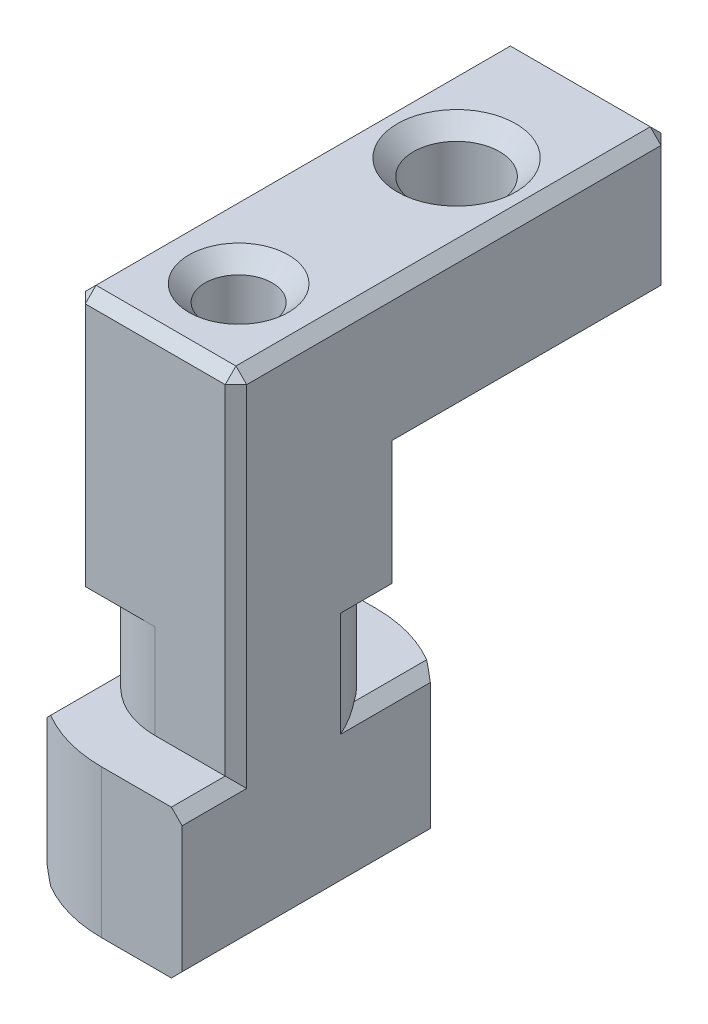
ISO-10303-21;
HEADER;
FILE_DESCRIPTION(('STEP AP214'),'2;1');
FILE_NAME('part.step','',(''),(''),'','','');
FILE_SCHEMA(('AUTOMOTIVE_DESIGN { 1 0 10303 214 1 1 1 1 }'));
ENDSEC;
DATA;
#1=APPLICATION_CONTEXT('core data for automotive mechanical design processes');
#2=APPLICATION_PROTOCOL_DEFINITION('international standard','automotive_design',2000,#1);
#3=PRODUCT_CONTEXT('',#1,'mechanical');
#4=PRODUCT('Part','Part','',(#3));
#5=PRODUCT_RELATED_PRODUCT_CATEGORY('part','',(#4));
#6=PRODUCT_DEFINITION_FORMATION('','',#4);
#7=PRODUCT_DEFINITION_CONTEXT('part definition',#1,'design');
#8=PRODUCT_DEFINITION('design','',#6,#7);
#9=PRODUCT_DEFINITION_SHAPE('','',#8);
#10=(LENGTH_UNIT() NAMED_UNIT(*) SI_UNIT(.MILLI.,.METRE.));
#11=(NAMED_UNIT(*) PLANE_ANGLE_UNIT() SI_UNIT($,.RADIAN.));
#12=(NAMED_UNIT(*) SI_UNIT($,.STERADIAN.) SOLID_ANGLE_UNIT());
#13=UNCERTAINTY_MEASURE_WITH_UNIT(LENGTH_MEASURE(1.E-05),#10,'distance_accuracy_value','');
#14=(GEOMETRIC_REPRESENTATION_CONTEXT(3) GLOBAL_UNCERTAINTY_ASSIGNED_CONTEXT((#13)) GLOBAL_UNIT_ASSIGNED_CONTEXT((#10,
#11,#12)) REPRESENTATION_CONTEXT('',''));
#15=CARTESIAN_POINT('',(0.,0.,0.));
#16=DIRECTION('',(0.,0.,1.));
#17=DIRECTION('',(1.,0.,0.));
#18=AXIS2_PLACEMENT_3D('',#15,#16,#17);
#19=CARTESIAN_POINT('',(0.,5.5,0.));
#20=DIRECTION('',(0.,1.,0.));
#21=DIRECTION('',(0.,0.,1.));
#22=AXIS2_PLACEMENT_3D('',#19,#20,#21);
#23=PLANE('',#22);
#24=CARTESIAN_POINT('',(0.,5.5,0.));
#25=DIRECTION('',(0.,1.,0.));
#26=DIRECTION('',(0.,0.,-1.));
#27=AXIS2_PLACEMENT_3D('',#24,#25,#26);
#28=CIRCLE('',#27,3.1);
#29=CARTESIAN_POINT('',(2.60000000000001,5.5,-1.6881943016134));
#30=VERTEX_POINT('',#29);
#31=CARTESIAN_POINT('',(0.,5.5,-3.1));
#32=VERTEX_POINT('',#31);
#33=EDGE_CURVE('E257',#30,#32,#28,.T.);
#34=ORIENTED_EDGE('',*,*,#33,.F.);
#35=DIRECTION('',(0.,0.,-1.));
#36=VECTOR('',#35,1.);
#37=CARTESIAN_POINT('',(2.60000000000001,5.5,-4.12431812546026));
#38=LINE('',#37,#36);
#39=CARTESIAN_POINT('',(2.60000000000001,5.5,-4.38748219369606));
#40=VERTEX_POINT('',#39);
#41=EDGE_CURVE('E324',#30,#40,#38,.T.);
#42=ORIENTED_EDGE('',*,*,#41,.T.);
#43=CARTESIAN_POINT('',(0.,5.5,0.));
#44=DIRECTION('',(0.,1.,0.));
#45=DIRECTION('',(0.,0.,1.));
#46=AXIS2_PLACEMENT_3D('',#43,#44,#45);
#47=CIRCLE('',#46,5.1);
#48=CARTESIAN_POINT('',(0.,5.5,-5.1));
#49=VERTEX_POINT('',#48);
#50=EDGE_CURVE('E291',#40,#49,#47,.T.);
#51=ORIENTED_EDGE('',*,*,#50,.T.);
#52=DIRECTION('',(-1.,0.,0.));
#53=VECTOR('',#52,1.);
#54=CARTESIAN_POINT('',(0.,5.5,-5.1));
#55=LINE('',#54,#53);
#56=CARTESIAN_POINT('',(-2.6,5.5,-5.1));
#57=VERTEX_POINT('',#56);
#58=EDGE_CURVE('E293',#49,#57,#55,.T.);
#59=ORIENTED_EDGE('',*,*,#58,.T.);
#60=DIRECTION('',(0.,0.,1.));
#61=VECTOR('',#60,1.);
#62=CARTESIAN_POINT('',(-2.6,5.5,-3.1));
#63=LINE('',#62,#61);
#64=CARTESIAN_POINT('',(-2.6,5.5,-3.1));
#65=VERTEX_POINT('',#64);
#66=EDGE_CURVE('E322',#57,#65,#63,.T.);
#67=ORIENTED_EDGE('',*,*,#66,.T.);
#68=DIRECTION('',(-1.,0.,0.));
#69=VECTOR('',#68,1.);
#70=CARTESIAN_POINT('',(-3.,5.5,-3.1));
#71=LINE('',#70,#69);
#72=EDGE_CURVE('E266',#32,#65,#71,.T.);
#73=ORIENTED_EDGE('',*,*,#72,.F.);
#74=EDGE_LOOP('',(#34,#42,#51,#59,#67,#73));
#75=FACE_BOUND('',#74,.T.);
#76=ADVANCED_FACE('F39',(#75),#23,.T.);
#77=CARTESIAN_POINT('',(0.,5.5,0.));
#78=DIRECTION('',(0.,-1.,0.));
#79=DIRECTION('',(0.,0.,-1.));
#80=AXIS2_PLACEMENT_3D('',#77,#78,#79);
#81=CYLINDRICAL_SURFACE('',#80,5.1);
#82=CARTESIAN_POINT('',(0.,5.5,0.));
#83=DIRECTION('',(0.,1.,0.));
#84=DIRECTION('',(0.,0.,1.));
#85=AXIS2_PLACEMENT_3D('',#82,#83,#84);
#86=CIRCLE('',#85,5.1);
#87=CARTESIAN_POINT('',(-2.6,5.5,4.38748219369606));
#88=VERTEX_POINT('',#87);
#89=CARTESIAN_POINT('',(0.,5.5,5.1));
#90=VERTEX_POINT('',#89);
#91=EDGE_CURVE('E285',#88,#90,#86,.T.);
#92=ORIENTED_EDGE('',*,*,#91,.F.);
#93=CARTESIAN_POINT('',(0.,8.10000000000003,0.));
#94=DIRECTION('',(-0.707106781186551,0.707106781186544,0.));
#95=DIRECTION('',(-0.707106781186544,-0.707106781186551,0.));
#96=AXIS2_PLACEMENT_3D('',#93,#94,#95);
#97=ELLIPSE('',#96,7.21248916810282,5.1);
#98=CARTESIAN_POINT('',(-3.,5.1,4.12431812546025));
#99=VERTEX_POINT('',#98);
#100=EDGE_CURVE('E357',#88,#99,#97,.F.);
#101=ORIENTED_EDGE('',*,*,#100,.T.);
#102=DIRECTION('',(0.,-1.,0.));
#103=VECTOR('',#102,1.);
#104=CARTESIAN_POINT('',(-3.,5.5,4.12431812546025));
#105=LINE('',#104,#103);
#106=CARTESIAN_POINT('',(-3.,0.400000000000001,4.12431812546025));
#107=VERTEX_POINT('',#106);
#108=EDGE_CURVE('E296',#99,#107,#105,.T.);
#109=ORIENTED_EDGE('',*,*,#108,.T.);
#110=CARTESIAN_POINT('',(0.,-2.6,0.));
#111=DIRECTION('',(0.707106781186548,0.707106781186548,0.));
#112=DIRECTION('',(0.707106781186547,-0.707106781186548,0.));
#113=AXIS2_PLACEMENT_3D('',#110,#111,#112);
#114=ELLIPSE('',#113,7.21248916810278,5.1);
#115=CARTESIAN_POINT('',(-2.6,0.,4.38748219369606));
#116=VERTEX_POINT('',#115);
#117=EDGE_CURVE('E355',#107,#116,#114,.T.);
#118=ORIENTED_EDGE('',*,*,#117,.T.);
#119=CARTESIAN_POINT('',(0.,0.,0.));
#120=DIRECTION('',(0.,1.,0.));
#121=DIRECTION('',(0.,0.,1.));
#122=AXIS2_PLACEMENT_3D('',#119,#120,#121);
#123=CIRCLE('',#122,5.1);
#124=CARTESIAN_POINT('',(0.,0.,5.1));
#125=VERTEX_POINT('',#124);
#126=EDGE_CURVE('E284',#116,#125,#123,.T.);
#127=ORIENTED_EDGE('',*,*,#126,.T.);
#128=DIRECTION('',(0.,-1.,0.));
#129=VECTOR('',#128,1.);
#130=CARTESIAN_POINT('',(0.,5.5,5.1));
#131=LINE('',#130,#129);
#132=EDGE_CURVE('E319',#90,#125,#131,.T.);
#133=ORIENTED_EDGE('',*,*,#132,.F.);
#134=EDGE_LOOP('',(#92,#101,#109,#118,#127,#133));
#135=FACE_BOUND('',#134,.T.);
#136=ADVANCED_FACE('F519',(#135),#81,.T.);
#137=CARTESIAN_POINT('',(0.,5.5,5.1));
#138=DIRECTION('',(0.,0.,-1.));
#139=DIRECTION('',(-1.,0.,0.));
#140=AXIS2_PLACEMENT_3D('',#137,#138,#139);
#141=PLANE('',#140);
#142=DIRECTION('',(1.,0.,0.));
#143=VECTOR('',#142,1.);
#144=CARTESIAN_POINT('',(0.,0.,5.1));
#145=LINE('',#144,#143);
#146=CARTESIAN_POINT('',(2.6,0.,5.1));
#147=VERTEX_POINT('',#146);
#148=EDGE_CURVE('E298',#125,#147,#145,.T.);
#149=ORIENTED_EDGE('',*,*,#148,.T.);
#150=DIRECTION('',(-0.707106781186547,-0.707106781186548,0.));
#151=VECTOR('',#150,1.);
#152=CARTESIAN_POINT('',(3.,0.399999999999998,5.1));
#153=LINE('',#152,#151);
#154=CARTESIAN_POINT('',(3.,0.399999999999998,5.1));
#155=VERTEX_POINT('',#154);
#156=EDGE_CURVE('E387',#147,#155,#153,.F.);
#157=ORIENTED_EDGE('',*,*,#156,.T.);
#158=DIRECTION('',(0.,-1.,0.));
#159=VECTOR('',#158,1.);
#160=CARTESIAN_POINT('',(3.,5.5,5.1));
#161=LINE('',#160,#159);
#162=CARTESIAN_POINT('',(3.,5.1,5.1));
#163=VERTEX_POINT('',#162);
#164=EDGE_CURVE('E316',#163,#155,#161,.T.);
#165=ORIENTED_EDGE('',*,*,#164,.F.);
#166=DIRECTION('',(-0.707106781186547,0.707106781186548,0.));
#167=VECTOR('',#166,1.);
#168=CARTESIAN_POINT('',(2.6,5.5,5.1));
#169=LINE('',#168,#167);
#170=CARTESIAN_POINT('',(2.6,5.5,5.1));
#171=VERTEX_POINT('',#170);
#172=EDGE_CURVE('E385',#163,#171,#169,.T.);
#173=ORIENTED_EDGE('',*,*,#172,.T.);
#174=DIRECTION('',(1.,0.,0.));
#175=VECTOR('',#174,1.);
#176=CARTESIAN_POINT('',(0.,5.5,5.1));
#177=LINE('',#176,#175);
#178=EDGE_CURVE('E287',#90,#171,#177,.T.);
#179=ORIENTED_EDGE('',*,*,#178,.F.);
#180=ORIENTED_EDGE('',*,*,#132,.T.);
#181=EDGE_LOOP('',(#149,#157,#165,#173,#179,#180));
#182=FACE_BOUND('',#181,.T.);
#183=ADVANCED_FACE('F526',(#182),#141,.F.);
#184=CARTESIAN_POINT('',(3.,5.5,5.1));
#185=DIRECTION('',(-1.,0.,0.));
#186=DIRECTION('',(0.,0.,1.));
#187=AXIS2_PLACEMENT_3D('',#184,#185,#186);
#188=PLANE('',#187);
#189=DIRECTION('',(0.,-1.,0.));
#190=VECTOR('',#189,1.);
#191=CARTESIAN_POINT('',(3.,5.5,-4.12431812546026));
#192=LINE('',#191,#190);
#193=CARTESIAN_POINT('',(3.,5.1,-4.12431812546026));
#194=VERTEX_POINT('',#193);
#195=CARTESIAN_POINT('',(3.,0.399999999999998,-4.12431812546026));
#196=VERTEX_POINT('',#195);
#197=EDGE_CURVE('E313',#194,#196,#192,.T.);
#198=ORIENTED_EDGE('',*,*,#197,.F.);
#199=DIRECTION('',(0.,0.,1.));
#200=VECTOR('',#199,1.);
#201=CARTESIAN_POINT('',(3.,5.1,-0.781024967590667));
#202=LINE('',#201,#200);
#203=CARTESIAN_POINT('',(3.,5.1,-0.781024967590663));
#204=VERTEX_POINT('',#203);
#205=EDGE_CURVE('E346',#194,#204,#202,.T.);
#206=ORIENTED_EDGE('',*,*,#205,.T.);
#207=DIRECTION('',(0.,-1.,0.));
#208=VECTOR('',#207,1.);
#209=CARTESIAN_POINT('',(3.,9.,-0.781024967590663));
#210=LINE('',#209,#208);
#211=CARTESIAN_POINT('',(3.,9.,-0.781024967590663));
#212=VERTEX_POINT('',#211);
#213=EDGE_CURVE('E259',#212,#204,#210,.T.);
#214=ORIENTED_EDGE('',*,*,#213,.F.);
#215=DIRECTION('',(0.,0.,-1.));
#216=VECTOR('',#215,1.);
#217=CARTESIAN_POINT('',(3.,9.,-3.1));
#218=LINE('',#217,#216);
#219=CARTESIAN_POINT('',(3.,9.,-2.7));
#220=VERTEX_POINT('',#219);
#221=EDGE_CURVE('E249',#212,#220,#218,.T.);
#222=ORIENTED_EDGE('',*,*,#221,.T.);
#223=DIRECTION('',(0.,1.,0.));
#224=VECTOR('',#223,1.);
#225=CARTESIAN_POINT('',(3.,5.5,-2.7));
#226=LINE('',#225,#224);
#227=CARTESIAN_POINT('',(3.,13.6,-2.7));
#228=VERTEX_POINT('',#227);
#229=EDGE_CURVE('E333',#220,#228,#226,.T.);
#230=ORIENTED_EDGE('',*,*,#229,.T.);
#231=DIRECTION('',(0.,0.,-1.));
#232=VECTOR('',#231,1.);
#233=CARTESIAN_POINT('',(3.,13.6,5.1));
#234=LINE('',#233,#232);
#235=CARTESIAN_POINT('',(3.,13.6,-12.7));
#236=VERTEX_POINT('',#235);
#237=EDGE_CURVE('E331',#228,#236,#234,.T.);
#238=ORIENTED_EDGE('',*,*,#237,.T.);
#239=DIRECTION('',(0.,1.,0.));
#240=VECTOR('',#239,1.);
#241=CARTESIAN_POINT('',(3.,5.5,-12.7));
#242=LINE('',#241,#240);
#243=CARTESIAN_POINT('',(3.,18.1,-12.7));
#244=VERTEX_POINT('',#243);
#245=EDGE_CURVE('E335',#236,#244,#242,.T.);
#246=ORIENTED_EDGE('',*,*,#245,.T.);
#247=DIRECTION('',(0.,0.,1.));
#248=VECTOR('',#247,1.);
#249=CARTESIAN_POINT('',(3.,18.1,3.1));
#250=LINE('',#249,#248);
#251=CARTESIAN_POINT('',(3.,18.1,2.7));
#252=VERTEX_POINT('',#251);
#253=EDGE_CURVE('E337',#244,#252,#250,.T.);
#254=ORIENTED_EDGE('',*,*,#253,.T.);
#255=DIRECTION('',(0.,-1.,0.));
#256=VECTOR('',#255,1.);
#257=CARTESIAN_POINT('',(3.,5.5,2.7));
#258=LINE('',#257,#256);
#259=CARTESIAN_POINT('',(3.,5.1,2.7));
#260=VERTEX_POINT('',#259);
#261=EDGE_CURVE('E339',#252,#260,#258,.T.);
#262=ORIENTED_EDGE('',*,*,#261,.T.);
#263=DIRECTION('',(0.,0.,1.));
#264=VECTOR('',#263,1.);
#265=CARTESIAN_POINT('',(3.,5.1,5.1));
#266=LINE('',#265,#264);
#267=EDGE_CURVE('E341',#260,#163,#266,.T.);
#268=ORIENTED_EDGE('',*,*,#267,.T.);
#269=ORIENTED_EDGE('',*,*,#164,.T.);
#270=DIRECTION('',(0.,0.,-1.));
#271=VECTOR('',#270,1.);
#272=CARTESIAN_POINT('',(3.,0.399999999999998,5.1));
#273=LINE('',#272,#271);
#274=EDGE_CURVE('E343',#155,#196,#273,.T.);
#275=ORIENTED_EDGE('',*,*,#274,.T.);
#276=EDGE_LOOP('',(#198,#206,#214,#222,#230,#238,#246,#254,#262,#268,#269,#275));
#277=FACE_BOUND('',#276,.T.);
#278=ADVANCED_FACE('F712',(#277),#188,.F.);
#279=CARTESIAN_POINT('',(0.,5.5,0.));
#280=DIRECTION('',(0.,-1.,0.));
#281=DIRECTION('',(0.,0.,-1.));
#282=AXIS2_PLACEMENT_3D('',#279,#280,#281);
#283=CYLINDRICAL_SURFACE('',#282,5.1);
#284=ORIENTED_EDGE('',*,*,#50,.F.);
#285=CARTESIAN_POINT('',(0.,8.10000000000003,0.));
#286=DIRECTION('',(0.707106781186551,0.707106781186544,0.));
#287=DIRECTION('',(0.707106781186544,-0.707106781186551,0.));
#288=AXIS2_PLACEMENT_3D('',#285,#286,#287);
#289=ELLIPSE('',#288,7.21248916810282,5.1);
#290=EDGE_CURVE('E329',#40,#194,#289,.F.);
#291=ORIENTED_EDGE('',*,*,#290,.T.);
#292=ORIENTED_EDGE('',*,*,#197,.T.);
#293=CARTESIAN_POINT('',(0.,-2.6,0.));
#294=DIRECTION('',(-0.707106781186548,0.707106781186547,0.));
#295=DIRECTION('',(-0.707106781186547,-0.707106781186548,0.));
#296=AXIS2_PLACEMENT_3D('',#293,#294,#295);
#297=ELLIPSE('',#296,7.21248916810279,5.1);
#298=CARTESIAN_POINT('',(2.6,0.,-4.38748219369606));
#299=VERTEX_POINT('',#298);
#300=EDGE_CURVE('E327',#196,#299,#297,.T.);
#301=ORIENTED_EDGE('',*,*,#300,.T.);
#302=CARTESIAN_POINT('',(0.,0.,0.));
#303=DIRECTION('',(0.,1.,0.));
#304=DIRECTION('',(0.,0.,1.));
#305=AXIS2_PLACEMENT_3D('',#302,#303,#304);
#306=CIRCLE('',#305,5.1);
#307=CARTESIAN_POINT('',(0.,0.,-5.1));
#308=VERTEX_POINT('',#307);
#309=EDGE_CURVE('E301',#299,#308,#306,.T.);
#310=ORIENTED_EDGE('',*,*,#309,.T.);
#311=DIRECTION('',(0.,-1.,0.));
#312=VECTOR('',#311,1.);
#313=CARTESIAN_POINT('',(0.,5.5,-5.1));
#314=LINE('',#313,#312);
#315=EDGE_CURVE('E310',#49,#308,#314,.T.);
#316=ORIENTED_EDGE('',*,*,#315,.F.);
#317=EDGE_LOOP('',(#284,#291,#292,#301,#310,#316));
#318=FACE_BOUND('',#317,.T.);
#319=ADVANCED_FACE('F726',(#318),#283,.T.);
#320=CARTESIAN_POINT('',(0.,5.5,-5.1));
#321=DIRECTION('',(0.,0.,1.));
#322=DIRECTION('',(1.,0.,0.));
#323=AXIS2_PLACEMENT_3D('',#320,#321,#322);
#324=PLANE('',#323);
#325=DIRECTION('',(-1.,0.,0.));
#326=VECTOR('',#325,1.);
#327=CARTESIAN_POINT('',(0.,0.,-5.1));
#328=LINE('',#327,#326);
#329=CARTESIAN_POINT('',(-2.6,0.,-5.1));
#330=VERTEX_POINT('',#329);
#331=EDGE_CURVE('E288',#308,#330,#328,.T.);
#332=ORIENTED_EDGE('',*,*,#331,.T.);
#333=DIRECTION('',(0.707106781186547,-0.707106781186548,0.));
#334=VECTOR('',#333,1.);
#335=CARTESIAN_POINT('',(-3.,0.400000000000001,-5.1));
#336=LINE('',#335,#334);
#337=CARTESIAN_POINT('',(-3.,0.400000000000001,-5.1));
#338=VERTEX_POINT('',#337);
#339=EDGE_CURVE('E383',#330,#338,#336,.F.);
#340=ORIENTED_EDGE('',*,*,#339,.T.);
#341=DIRECTION('',(0.,-1.,0.));
#342=VECTOR('',#341,1.);
#343=CARTESIAN_POINT('',(-3.,5.5,-5.1));
#344=LINE('',#343,#342);
#345=CARTESIAN_POINT('',(-3.,5.1,-5.1));
#346=VERTEX_POINT('',#345);
#347=EDGE_CURVE('E307',#346,#338,#344,.T.);
#348=ORIENTED_EDGE('',*,*,#347,.F.);
#349=DIRECTION('',(0.707106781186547,0.707106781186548,0.));
#350=VECTOR('',#349,1.);
#351=CARTESIAN_POINT('',(-2.6,5.5,-5.1));
#352=LINE('',#351,#350);
#353=EDGE_CURVE('E381',#346,#57,#352,.T.);
#354=ORIENTED_EDGE('',*,*,#353,.T.);
#355=ORIENTED_EDGE('',*,*,#58,.F.);
#356=ORIENTED_EDGE('',*,*,#315,.T.);
#357=EDGE_LOOP('',(#332,#340,#348,#354,#355,#356));
#358=FACE_BOUND('',#357,.T.);
#359=ADVANCED_FACE('F541',(#358),#324,.F.);
#360=CARTESIAN_POINT('',(-3.,5.5,-5.1));
#361=DIRECTION('',(1.,0.,0.));
#362=DIRECTION('',(0.,0.,-1.));
#363=AXIS2_PLACEMENT_3D('',#360,#361,#362);
#364=PLANE('',#363);
#365=ORIENTED_EDGE('',*,*,#108,.F.);
#366=DIRECTION('',(0.,0.,-1.));
#367=VECTOR('',#366,1.);
#368=CARTESIAN_POINT('',(-3.,5.1,0.781024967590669));
#369=LINE('',#368,#367);
#370=CARTESIAN_POINT('',(-3.,5.1,0.781024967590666));
#371=VERTEX_POINT('',#370);
#372=EDGE_CURVE('E374',#99,#371,#369,.T.);
#373=ORIENTED_EDGE('',*,*,#372,.T.);
#374=DIRECTION('',(0.,-1.,0.));
#375=VECTOR('',#374,1.);
#376=CARTESIAN_POINT('',(-3.,9.,0.781024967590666));
#377=LINE('',#376,#375);
#378=CARTESIAN_POINT('',(-3.,9.,0.781024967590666));
#379=VERTEX_POINT('',#378);
#380=EDGE_CURVE('E282',#379,#371,#377,.T.);
#381=ORIENTED_EDGE('',*,*,#380,.F.);
#382=DIRECTION('',(0.,0.,1.));
#383=VECTOR('',#382,1.);
#384=CARTESIAN_POINT('',(-3.,9.,-3.1));
#385=LINE('',#384,#383);
#386=CARTESIAN_POINT('',(-3.,9.,2.7));
#387=VERTEX_POINT('',#386);
#388=EDGE_CURVE('E248',#379,#387,#385,.T.);
#389=ORIENTED_EDGE('',*,*,#388,.T.);
#390=DIRECTION('',(0.,1.,0.));
#391=VECTOR('',#390,1.);
#392=CARTESIAN_POINT('',(-3.,5.5,2.7));
#393=LINE('',#392,#391);
#394=CARTESIAN_POINT('',(-3.,18.1,2.7));
#395=VERTEX_POINT('',#394);
#396=EDGE_CURVE('E369',#387,#395,#393,.T.);
#397=ORIENTED_EDGE('',*,*,#396,.T.);
#398=DIRECTION('',(0.,0.,-1.));
#399=VECTOR('',#398,1.);
#400=CARTESIAN_POINT('',(-3.,18.1,-13.1));
#401=LINE('',#400,#399);
#402=CARTESIAN_POINT('',(-3.,18.1,-12.7));
#403=VERTEX_POINT('',#402);
#404=EDGE_CURVE('E367',#395,#403,#401,.T.);
#405=ORIENTED_EDGE('',*,*,#404,.T.);
#406=DIRECTION('',(0.,-1.,0.));
#407=VECTOR('',#406,1.);
#408=CARTESIAN_POINT('',(-3.,5.5,-12.7));
#409=LINE('',#408,#407);
#410=CARTESIAN_POINT('',(-3.,13.6,-12.7));
#411=VERTEX_POINT('',#410);
#412=EDGE_CURVE('E365',#403,#411,#409,.T.);
#413=ORIENTED_EDGE('',*,*,#412,.T.);
#414=DIRECTION('',(0.,0.,1.));
#415=VECTOR('',#414,1.);
#416=CARTESIAN_POINT('',(-3.,13.6,-5.1));
#417=LINE('',#416,#415);
#418=CARTESIAN_POINT('',(-3.,13.6,-2.7));
#419=VERTEX_POINT('',#418);
#420=EDGE_CURVE('E363',#411,#419,#417,.T.);
#421=ORIENTED_EDGE('',*,*,#420,.T.);
#422=DIRECTION('',(0.,-1.,0.));
#423=VECTOR('',#422,1.);
#424=CARTESIAN_POINT('',(-3.,5.5,-2.7));
#425=LINE('',#424,#423);
#426=CARTESIAN_POINT('',(-3.,5.1,-2.7));
#427=VERTEX_POINT('',#426);
#428=EDGE_CURVE('E359',#419,#427,#425,.T.);
#429=ORIENTED_EDGE('',*,*,#428,.T.);
#430=DIRECTION('',(0.,0.,-1.));
#431=VECTOR('',#430,1.);
#432=CARTESIAN_POINT('',(-3.,5.1,-5.1));
#433=LINE('',#432,#431);
#434=EDGE_CURVE('E361',#427,#346,#433,.T.);
#435=ORIENTED_EDGE('',*,*,#434,.T.);
#436=ORIENTED_EDGE('',*,*,#347,.T.);
#437=DIRECTION('',(0.,0.,1.));
#438=VECTOR('',#437,1.);
#439=CARTESIAN_POINT('',(-3.,0.400000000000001,-5.1));
#440=LINE('',#439,#438);
#441=EDGE_CURVE('E371',#338,#107,#440,.T.);
#442=ORIENTED_EDGE('',*,*,#441,.T.);
#443=EDGE_LOOP('',(#365,#373,#381,#389,#397,#405,#413,#421,#429,#435,#436,#442));
#444=FACE_BOUND('',#443,.T.);
#445=ADVANCED_FACE('F533',(#444),#364,.F.);
#446=CARTESIAN_POINT('',(0.,5.5,0.));
#447=DIRECTION('',(0.,1.,0.));
#448=DIRECTION('',(0.,0.,-1.));
#449=AXIS2_PLACEMENT_3D('',#446,#447,#448);
#450=CIRCLE('',#449,3.1);
#451=CARTESIAN_POINT('',(-2.60000000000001,5.5,1.68819430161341));
#452=VERTEX_POINT('',#451);
#453=CARTESIAN_POINT('',(0.,5.5,3.1));
#454=VERTEX_POINT('',#453);
#455=EDGE_CURVE('E270',#452,#454,#450,.T.);
#456=ORIENTED_EDGE('',*,*,#455,.F.);
#457=DIRECTION('',(0.,0.,1.));
#458=VECTOR('',#457,1.);
#459=CARTESIAN_POINT('',(-2.6,5.5,4.12431812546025));
#460=LINE('',#459,#458);
#461=EDGE_CURVE('E352',#452,#88,#460,.T.);
#462=ORIENTED_EDGE('',*,*,#461,.T.);
#463=ORIENTED_EDGE('',*,*,#91,.T.);
#464=ORIENTED_EDGE('',*,*,#178,.T.);
#465=DIRECTION('',(0.,0.,-1.));
#466=VECTOR('',#465,1.);
#467=CARTESIAN_POINT('',(2.6,5.5,3.1));
#468=LINE('',#467,#466);
#469=CARTESIAN_POINT('',(2.6,5.5,3.1));
#470=VERTEX_POINT('',#469);
#471=EDGE_CURVE('E349',#171,#470,#468,.T.);
#472=ORIENTED_EDGE('',*,*,#471,.T.);
#473=DIRECTION('',(1.,0.,0.));
#474=VECTOR('',#473,1.);
#475=CARTESIAN_POINT('',(3.,5.5,3.1));
#476=LINE('',#475,#474);
#477=EDGE_CURVE('E272',#454,#470,#476,.T.);
#478=ORIENTED_EDGE('',*,*,#477,.F.);
#479=EDGE_LOOP('',(#456,#462,#463,#464,#472,#478));
#480=FACE_BOUND('',#479,.T.);
#481=ADVANCED_FACE('F522',(#480),#23,.T.);
#482=CARTESIAN_POINT('',(0.,0.,0.));
#483=DIRECTION('',(0.,1.,0.));
#484=DIRECTION('',(0.,0.,1.));
#485=AXIS2_PLACEMENT_3D('',#482,#483,#484);
#486=PLANE('',#485);
#487=CARTESIAN_POINT('',(0.,0.,0.));
#488=DIRECTION('',(0.,1.,0.));
#489=DIRECTION('',(0.,0.,1.));
#490=AXIS2_PLACEMENT_3D('',#487,#488,#489);
#491=CIRCLE('',#490,2.50000000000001);
#492=CARTESIAN_POINT('',(0.,0.,-2.50000000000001));
#493=VERTEX_POINT('',#492);
#494=EDGE_CURVE('E11',#493,#493,#491,.T.);
#495=ORIENTED_EDGE('',*,*,#494,.T.);
#496=EDGE_LOOP('',(#495));
#497=FACE_BOUND('',#496,.T.);
#498=ORIENTED_EDGE('',*,*,#126,.F.);
#499=DIRECTION('',(0.,0.,-1.));
#500=VECTOR('',#499,1.);
#501=CARTESIAN_POINT('',(-2.6,0.,0.));
#502=LINE('',#501,#500);
#503=EDGE_CURVE('E379',#116,#330,#502,.T.);
#504=ORIENTED_EDGE('',*,*,#503,.T.);
#505=ORIENTED_EDGE('',*,*,#331,.F.);
#506=ORIENTED_EDGE('',*,*,#309,.F.);
#507=DIRECTION('',(0.,0.,1.));
#508=VECTOR('',#507,1.);
#509=CARTESIAN_POINT('',(2.6,0.,0.));
#510=LINE('',#509,#508);
#511=EDGE_CURVE('E377',#299,#147,#510,.T.);
#512=ORIENTED_EDGE('',*,*,#511,.T.);
#513=ORIENTED_EDGE('',*,*,#148,.F.);
#514=EDGE_LOOP('',(#498,#504,#505,#506,#512,#513));
#515=FACE_BOUND('',#514,.T.);
#516=ADVANCED_FACE('F532',(#497,#515),#486,.F.);
#517=CARTESIAN_POINT('',(0.,9.,0.));
#518=DIRECTION('',(0.,-1.,0.));
#519=DIRECTION('',(0.,0.,-1.));
#520=AXIS2_PLACEMENT_3D('',#517,#518,#519);
#521=CYLINDRICAL_SURFACE('',#520,3.1);
#522=ORIENTED_EDGE('',*,*,#380,.T.);
#523=CARTESIAN_POINT('',(0.,8.10000000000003,0.));
#524=DIRECTION('',(-0.707106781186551,0.707106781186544,0.));
#525=DIRECTION('',(-0.707106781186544,-0.707106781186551,0.));
#526=AXIS2_PLACEMENT_3D('',#523,#524,#525);
#527=ELLIPSE('',#526,4.38406204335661,3.1);
#528=EDGE_CURVE('E426',#371,#452,#527,.T.);
#529=ORIENTED_EDGE('',*,*,#528,.T.);
#530=ORIENTED_EDGE('',*,*,#455,.T.);
#531=DIRECTION('',(0.,-1.,0.));
#532=VECTOR('',#531,1.);
#533=CARTESIAN_POINT('',(0.,9.,3.1));
#534=LINE('',#533,#532);
#535=CARTESIAN_POINT('',(0.,9.,3.1));
#536=VERTEX_POINT('',#535);
#537=EDGE_CURVE('E279',#536,#454,#534,.T.);
#538=ORIENTED_EDGE('',*,*,#537,.F.);
#539=CARTESIAN_POINT('',(0.,9.,0.));
#540=DIRECTION('',(0.,1.,0.));
#541=DIRECTION('',(0.,0.,-1.));
#542=AXIS2_PLACEMENT_3D('',#539,#540,#541);
#543=CIRCLE('',#542,3.1);
#544=EDGE_CURVE('E263',#379,#536,#543,.T.);
#545=ORIENTED_EDGE('',*,*,#544,.F.);
#546=EDGE_LOOP('',(#522,#529,#530,#538,#545));
#547=FACE_BOUND('',#546,.T.);
#548=ADVANCED_FACE('F539',(#547),#521,.T.);
#549=CARTESIAN_POINT('',(3.,9.,3.1));
#550=DIRECTION('',(0.,0.,-1.));
#551=DIRECTION('',(-1.,0.,0.));
#552=AXIS2_PLACEMENT_3D('',#549,#550,#551);
#553=PLANE('',#552);
#554=ORIENTED_EDGE('',*,*,#477,.T.);
#555=DIRECTION('',(0.,1.,0.));
#556=VECTOR('',#555,1.);
#557=CARTESIAN_POINT('',(2.6,9.,3.1));
#558=LINE('',#557,#556);
#559=CARTESIAN_POINT('',(2.6,18.1,3.1));
#560=VERTEX_POINT('',#559);
#561=EDGE_CURVE('E393',#470,#560,#558,.T.);
#562=ORIENTED_EDGE('',*,*,#561,.T.);
#563=DIRECTION('',(-1.,0.,0.));
#564=VECTOR('',#563,1.);
#565=CARTESIAN_POINT('',(-3.,18.1,3.1));
#566=LINE('',#565,#564);
#567=CARTESIAN_POINT('',(-2.6,18.1,3.1));
#568=VERTEX_POINT('',#567);
#569=EDGE_CURVE('E391',#560,#568,#566,.T.);
#570=ORIENTED_EDGE('',*,*,#569,.T.);
#571=DIRECTION('',(0.,-1.,0.));
#572=VECTOR('',#571,1.);
#573=CARTESIAN_POINT('',(-2.6,9.,3.1));
#574=LINE('',#573,#572);
#575=CARTESIAN_POINT('',(-2.6,9.,3.1));
#576=VERTEX_POINT('',#575);
#577=EDGE_CURVE('E389',#568,#576,#574,.T.);
#578=ORIENTED_EDGE('',*,*,#577,.T.);
#579=DIRECTION('',(1.,0.,0.));
#580=VECTOR('',#579,1.);
#581=CARTESIAN_POINT('',(-3.,9.,3.1));
#582=LINE('',#581,#580);
#583=EDGE_CURVE('E617',#576,#536,#582,.T.);
#584=ORIENTED_EDGE('',*,*,#583,.T.);
#585=ORIENTED_EDGE('',*,*,#537,.T.);
#586=EDGE_LOOP('',(#554,#562,#570,#578,#584,#585));
#587=FACE_BOUND('',#586,.T.);
#588=ADVANCED_FACE('F586',(#587),#553,.F.);
#589=CARTESIAN_POINT('',(0.,9.,0.));
#590=DIRECTION('',(0.,-1.,0.));
#591=DIRECTION('',(0.,0.,-1.));
#592=AXIS2_PLACEMENT_3D('',#589,#590,#591);
#593=CYLINDRICAL_SURFACE('',#592,3.1);
#594=ORIENTED_EDGE('',*,*,#213,.T.);
#595=CARTESIAN_POINT('',(0.,8.10000000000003,0.));
#596=DIRECTION('',(0.707106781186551,0.707106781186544,0.));
#597=DIRECTION('',(0.707106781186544,-0.707106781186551,0.));
#598=AXIS2_PLACEMENT_3D('',#595,#596,#597);
#599=ELLIPSE('',#598,4.38406204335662,3.1);
#600=EDGE_CURVE('E424',#204,#30,#599,.T.);
#601=ORIENTED_EDGE('',*,*,#600,.T.);
#602=ORIENTED_EDGE('',*,*,#33,.T.);
#603=DIRECTION('',(0.,-1.,0.));
#604=VECTOR('',#603,1.);
#605=CARTESIAN_POINT('',(0.,9.,-3.1));
#606=LINE('',#605,#604);
#607=CARTESIAN_POINT('',(0.,9.,-3.1));
#608=VERTEX_POINT('',#607);
#609=EDGE_CURVE('E242',#608,#32,#606,.T.);
#610=ORIENTED_EDGE('',*,*,#609,.F.);
#611=CARTESIAN_POINT('',(0.,9.,0.));
#612=DIRECTION('',(0.,1.,0.));
#613=DIRECTION('',(0.,0.,-1.));
#614=AXIS2_PLACEMENT_3D('',#611,#612,#613);
#615=CIRCLE('',#614,3.1);
#616=EDGE_CURVE('E254',#212,#608,#615,.T.);
#617=ORIENTED_EDGE('',*,*,#616,.F.);
#618=EDGE_LOOP('',(#594,#601,#602,#610,#617));
#619=FACE_BOUND('',#618,.T.);
#620=ADVANCED_FACE('F253',(#619),#593,.T.);
#621=CARTESIAN_POINT('',(-3.,9.,-3.1));
#622=DIRECTION('',(0.,0.,1.));
#623=DIRECTION('',(1.,0.,0.));
#624=AXIS2_PLACEMENT_3D('',#621,#622,#623);
#625=PLANE('',#624);
#626=DIRECTION('',(-1.,0.,0.));
#627=VECTOR('',#626,1.);
#628=CARTESIAN_POINT('',(-3.,13.2,-3.1));
#629=LINE('',#628,#627);
#630=CARTESIAN_POINT('',(2.6,13.2,-3.1));
#631=VERTEX_POINT('',#630);
#632=CARTESIAN_POINT('',(-2.6,13.2,-3.1));
#633=VERTEX_POINT('',#632);
#634=EDGE_CURVE('E273',#631,#633,#629,.T.);
#635=ORIENTED_EDGE('',*,*,#634,.F.);
#636=DIRECTION('',(0.,-1.,0.));
#637=VECTOR('',#636,1.);
#638=CARTESIAN_POINT('',(2.6,9.,-3.1));
#639=LINE('',#638,#637);
#640=CARTESIAN_POINT('',(2.6,9.,-3.1));
#641=VERTEX_POINT('',#640);
#642=EDGE_CURVE('E244',#631,#641,#639,.T.);
#643=ORIENTED_EDGE('',*,*,#642,.T.);
#644=DIRECTION('',(-1.,0.,0.));
#645=VECTOR('',#644,1.);
#646=CARTESIAN_POINT('',(-3.,9.,-3.1));
#647=LINE('',#646,#645);
#648=EDGE_CURVE('E237',#641,#608,#647,.T.);
#649=ORIENTED_EDGE('',*,*,#648,.T.);
#650=ORIENTED_EDGE('',*,*,#609,.T.);
#651=ORIENTED_EDGE('',*,*,#72,.T.);
#652=DIRECTION('',(0.,1.,0.));
#653=VECTOR('',#652,1.);
#654=CARTESIAN_POINT('',(-2.6,9.,-3.1));
#655=LINE('',#654,#653);
#656=EDGE_CURVE('E415',#65,#633,#655,.T.);
#657=ORIENTED_EDGE('',*,*,#656,.T.);
#658=EDGE_LOOP('',(#635,#643,#649,#650,#651,#657));
#659=FACE_BOUND('',#658,.T.);
#660=ADVANCED_FACE('F240',(#659),#625,.F.);
#661=CARTESIAN_POINT('',(0.,9.,0.));
#662=DIRECTION('',(0.,1.,0.));
#663=DIRECTION('',(0.,0.,1.));
#664=AXIS2_PLACEMENT_3D('',#661,#662,#663);
#665=PLANE('',#664);
#666=ORIENTED_EDGE('',*,*,#583,.F.);
#667=DIRECTION('',(0.707106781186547,0.,0.707106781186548));
#668=VECTOR('',#667,1.);
#669=CARTESIAN_POINT('',(-2.6,9.,3.1));
#670=LINE('',#669,#668);
#671=EDGE_CURVE('E413',#576,#387,#670,.F.);
#672=ORIENTED_EDGE('',*,*,#671,.T.);
#673=ORIENTED_EDGE('',*,*,#388,.F.);
#674=ORIENTED_EDGE('',*,*,#544,.T.);
#675=EDGE_LOOP('',(#666,#672,#673,#674));
#676=FACE_BOUND('',#675,.T.);
#677=ADVANCED_FACE('F619',(#676),#665,.F.);
#678=ORIENTED_EDGE('',*,*,#648,.F.);
#679=DIRECTION('',(-0.707106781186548,0.,-0.707106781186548));
#680=VECTOR('',#679,1.);
#681=CARTESIAN_POINT('',(2.6,9.,-3.1));
#682=LINE('',#681,#680);
#683=EDGE_CURVE('E418',#641,#220,#682,.F.);
#684=ORIENTED_EDGE('',*,*,#683,.T.);
#685=ORIENTED_EDGE('',*,*,#221,.F.);
#686=ORIENTED_EDGE('',*,*,#616,.T.);
#687=EDGE_LOOP('',(#678,#684,#685,#686));
#688=FACE_BOUND('',#687,.T.);
#689=ADVANCED_FACE('F261',(#688),#665,.F.);
#690=CARTESIAN_POINT('',(0.,13.2,0.));
#691=DIRECTION('',(0.,1.,0.));
#692=DIRECTION('',(0.,0.,1.));
#693=AXIS2_PLACEMENT_3D('',#690,#691,#692);
#694=PLANE('',#693);
#695=CARTESIAN_POINT('',(0.,13.2,-8.1));
#696=DIRECTION('',(0.,1.,0.));
#697=DIRECTION('',(0.,0.,1.));
#698=AXIS2_PLACEMENT_3D('',#695,#696,#697);
#699=CIRCLE('',#698,1.6);
#700=CARTESIAN_POINT('',(0.,13.2,-6.5));
#701=VERTEX_POINT('',#700);
#702=EDGE_CURVE('E492',#701,#701,#699,.F.);
#703=ORIENTED_EDGE('',*,*,#702,.F.);
#704=EDGE_LOOP('',(#703));
#705=FACE_BOUND('',#704,.T.);
#706=DIRECTION('',(1.,0.,0.));
#707=VECTOR('',#706,1.);
#708=CARTESIAN_POINT('',(0.,13.2,-12.7));
#709=LINE('',#708,#707);
#710=CARTESIAN_POINT('',(-2.6,13.2,-12.7));
#711=VERTEX_POINT('',#710);
#712=CARTESIAN_POINT('',(2.6,13.2,-12.7));
#713=VERTEX_POINT('',#712);
#714=EDGE_CURVE('E55',#711,#713,#709,.T.);
#715=ORIENTED_EDGE('',*,*,#714,.T.);
#716=DIRECTION('',(0.,0.,1.));
#717=VECTOR('',#716,1.);
#718=CARTESIAN_POINT('',(2.6,13.2,0.));
#719=LINE('',#718,#717);
#720=EDGE_CURVE('E422',#713,#631,#719,.T.);
#721=ORIENTED_EDGE('',*,*,#720,.T.);
#722=ORIENTED_EDGE('',*,*,#634,.T.);
#723=DIRECTION('',(0.,0.,-1.));
#724=VECTOR('',#723,1.);
#725=CARTESIAN_POINT('',(-2.6,13.2,0.));
#726=LINE('',#725,#724);
#727=EDGE_CURVE('E60',#633,#711,#726,.T.);
#728=ORIENTED_EDGE('',*,*,#727,.T.);
#729=EDGE_LOOP('',(#715,#721,#722,#728));
#730=FACE_BOUND('',#729,.T.);
#731=ADVANCED_FACE('F637',(#705,#730),#694,.F.);
#732=CARTESIAN_POINT('',(3.,18.5,-13.1));
#733=DIRECTION('',(0.,0.,1.));
#734=DIRECTION('',(1.,0.,0.));
#735=AXIS2_PLACEMENT_3D('',#732,#733,#734);
#736=PLANE('',#735);
#737=DIRECTION('',(1.,0.,0.));
#738=VECTOR('',#737,1.);
#739=CARTESIAN_POINT('',(3.,18.1,-13.1));
#740=LINE('',#739,#738);
#741=CARTESIAN_POINT('',(-2.6,18.1,-13.1));
#742=VERTEX_POINT('',#741);
#743=CARTESIAN_POINT('',(2.6,18.1,-13.1));
#744=VERTEX_POINT('',#743);
#745=EDGE_CURVE('E408',#742,#744,#740,.T.);
#746=ORIENTED_EDGE('',*,*,#745,.T.);
#747=DIRECTION('',(0.,-1.,0.));
#748=VECTOR('',#747,1.);
#749=CARTESIAN_POINT('',(2.6,18.5,-13.1));
#750=LINE('',#749,#748);
#751=CARTESIAN_POINT('',(2.6,13.6,-13.1));
#752=VERTEX_POINT('',#751);
#753=EDGE_CURVE('E410',#744,#752,#750,.T.);
#754=ORIENTED_EDGE('',*,*,#753,.T.);
#755=DIRECTION('',(-1.,0.,0.));
#756=VECTOR('',#755,1.);
#757=CARTESIAN_POINT('',(3.,13.6,-13.1));
#758=LINE('',#757,#756);
#759=CARTESIAN_POINT('',(-2.6,13.6,-13.1));
#760=VERTEX_POINT('',#759);
#761=EDGE_CURVE('E404',#752,#760,#758,.T.);
#762=ORIENTED_EDGE('',*,*,#761,.T.);
#763=DIRECTION('',(0.,1.,0.));
#764=VECTOR('',#763,1.);
#765=CARTESIAN_POINT('',(-2.6,18.5,-13.1));
#766=LINE('',#765,#764);
#767=EDGE_CURVE('E406',#760,#742,#766,.T.);
#768=ORIENTED_EDGE('',*,*,#767,.T.);
#769=EDGE_LOOP('',(#746,#754,#762,#768));
#770=FACE_BOUND('',#769,.T.);
#771=ADVANCED_FACE('F639',(#770),#736,.F.);
#772=CARTESIAN_POINT('',(0.,18.5,0.));
#773=DIRECTION('',(0.,1.,0.));
#774=DIRECTION('',(0.,0.,1.));
#775=AXIS2_PLACEMENT_3D('',#772,#773,#774);
#776=PLANE('',#775);
#777=CARTESIAN_POINT('',(0.,18.5,0.));
#778=DIRECTION('',(0.,1.,0.));
#779=DIRECTION('',(0.,0.,1.));
#780=AXIS2_PLACEMENT_3D('',#777,#778,#779);
#781=CIRCLE('',#780,1.85000000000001);
#782=CARTESIAN_POINT('',(0.,18.5,1.85000000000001));
#783=VERTEX_POINT('',#782);
#784=EDGE_CURVE('E498',#783,#783,#781,.F.);
#785=ORIENTED_EDGE('',*,*,#784,.T.);
#786=EDGE_LOOP('',(#785));
#787=FACE_BOUND('',#786,.T.);
#788=CARTESIAN_POINT('',(0.,18.5,-8.1));
#789=DIRECTION('',(0.,1.,0.));
#790=DIRECTION('',(0.,0.,1.));
#791=AXIS2_PLACEMENT_3D('',#788,#789,#790);
#792=CIRCLE('',#791,2.20000000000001);
#793=CARTESIAN_POINT('',(0.,18.5,-5.89999999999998));
#794=VERTEX_POINT('',#793);
#795=EDGE_CURVE('E495',#794,#794,#792,.F.);
#796=ORIENTED_EDGE('',*,*,#795,.T.);
#797=EDGE_LOOP('',(#796));
#798=FACE_BOUND('',#797,.T.);
#799=DIRECTION('',(0.,0.,1.));
#800=VECTOR('',#799,1.);
#801=CARTESIAN_POINT('',(-2.6,18.5,3.1));
#802=LINE('',#801,#800);
#803=CARTESIAN_POINT('',(-2.6,18.5,-12.7));
#804=VERTEX_POINT('',#803);
#805=CARTESIAN_POINT('',(-2.6,18.5,2.7));
#806=VERTEX_POINT('',#805);
#807=EDGE_CURVE('E395',#804,#806,#802,.T.);
#808=ORIENTED_EDGE('',*,*,#807,.T.);
#809=DIRECTION('',(1.,0.,0.));
#810=VECTOR('',#809,1.);
#811=CARTESIAN_POINT('',(3.,18.5,2.7));
#812=LINE('',#811,#810);
#813=CARTESIAN_POINT('',(2.6,18.5,2.7));
#814=VERTEX_POINT('',#813);
#815=EDGE_CURVE('E401',#806,#814,#812,.T.);
#816=ORIENTED_EDGE('',*,*,#815,.T.);
#817=DIRECTION('',(0.,0.,-1.));
#818=VECTOR('',#817,1.);
#819=CARTESIAN_POINT('',(2.6,18.5,-13.1));
#820=LINE('',#819,#818);
#821=CARTESIAN_POINT('',(2.6,18.5,-12.7));
#822=VERTEX_POINT('',#821);
#823=EDGE_CURVE('E399',#814,#822,#820,.T.);
#824=ORIENTED_EDGE('',*,*,#823,.T.);
#825=DIRECTION('',(-1.,0.,0.));
#826=VECTOR('',#825,1.);
#827=CARTESIAN_POINT('',(-3.,18.5,-12.7));
#828=LINE('',#827,#826);
#829=EDGE_CURVE('E397',#822,#804,#828,.T.);
#830=ORIENTED_EDGE('',*,*,#829,.T.);
#831=EDGE_LOOP('',(#808,#816,#824,#830));
#832=FACE_BOUND('',#831,.T.);
#833=ADVANCED_FACE('F603',(#787,#798,#832),#776,.T.);
#834=CARTESIAN_POINT('',(0.,4.5,0.));
#835=DIRECTION('',(0.,1.,0.));
#836=DIRECTION('',(0.,0.,1.));
#837=AXIS2_PLACEMENT_3D('',#834,#835,#836);
#838=CYLINDRICAL_SURFACE('',#837,1.25);
#839=CARTESIAN_POINT('',(0.,17.9,0.));
#840=DIRECTION('',(0.,1.,0.));
#841=DIRECTION('',(0.,0.,1.));
#842=AXIS2_PLACEMENT_3D('',#839,#840,#841);
#843=CIRCLE('',#842,1.25);
#844=CARTESIAN_POINT('',(0.,17.9,1.25));
#845=VERTEX_POINT('',#844);
#846=EDGE_CURVE('E428',#845,#845,#843,.T.);
#847=ORIENTED_EDGE('',*,*,#846,.T.);
#848=EDGE_LOOP('',(#847));
#849=FACE_BOUND('',#848,.T.);
#850=CARTESIAN_POINT('',(0.,4.5,0.));
#851=DIRECTION('',(0.,1.,0.));
#852=DIRECTION('',(0.,0.,1.));
#853=AXIS2_PLACEMENT_3D('',#850,#851,#852);
#854=CIRCLE('',#853,1.25);
#855=CARTESIAN_POINT('',(0.,4.5,1.25));
#856=VERTEX_POINT('',#855);
#857=EDGE_CURVE('E625',#856,#856,#854,.T.);
#858=ORIENTED_EDGE('',*,*,#857,.F.);
#859=EDGE_LOOP('',(#858));
#860=FACE_BOUND('',#859,.T.);
#861=ADVANCED_FACE('F881',(#849,#860),#838,.F.);
#862=CARTESIAN_POINT('',(0.,4.5,0.));
#863=DIRECTION('',(0.,-1.,0.));
#864=DIRECTION('',(0.,0.,-1.));
#865=AXIS2_PLACEMENT_3D('',#862,#863,#864);
#866=PLANE('',#865);
#867=CARTESIAN_POINT('',(0.,4.5,0.));
#868=DIRECTION('',(0.,-1.,0.));
#869=DIRECTION('',(0.,0.,-1.));
#870=AXIS2_PLACEMENT_3D('',#867,#868,#869);
#871=CIRCLE('',#870,1.9);
#872=CARTESIAN_POINT('',(0.,4.5,-1.9));
#873=VERTEX_POINT('',#872);
#874=EDGE_CURVE('E629',#873,#873,#871,.T.);
#875=ORIENTED_EDGE('',*,*,#874,.T.);
#876=EDGE_LOOP('',(#875));
#877=FACE_BOUND('',#876,.T.);
#878=ORIENTED_EDGE('',*,*,#857,.T.);
#879=EDGE_LOOP('',(#878));
#880=FACE_BOUND('',#879,.T.);
#881=ADVANCED_FACE('F884',(#877,#880),#866,.T.);
#882=CARTESIAN_POINT('',(0.,4.5,0.));
#883=DIRECTION('',(0.,-1.,0.));
#884=DIRECTION('',(0.,0.,-1.));
#885=AXIS2_PLACEMENT_3D('',#882,#883,#884);
#886=CYLINDRICAL_SURFACE('',#885,1.9);
#887=CARTESIAN_POINT('',(0.,0.600000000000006,0.));
#888=DIRECTION('',(0.,1.,0.));
#889=DIRECTION('',(0.,0.,1.));
#890=AXIS2_PLACEMENT_3D('',#887,#888,#889);
#891=CIRCLE('',#890,1.9);
#892=CARTESIAN_POINT('',(0.,0.600000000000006,-1.9));
#893=VERTEX_POINT('',#892);
#894=EDGE_CURVE('E48',#893,#893,#891,.F.);
#895=ORIENTED_EDGE('',*,*,#894,.T.);
#896=EDGE_LOOP('',(#895));
#897=FACE_BOUND('',#896,.T.);
#898=ORIENTED_EDGE('',*,*,#874,.F.);
#899=EDGE_LOOP('',(#898));
#900=FACE_BOUND('',#899,.T.);
#901=ADVANCED_FACE('F506',(#897,#900),#886,.F.);
#902=CARTESIAN_POINT('',(0.,-0.001000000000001,-8.1));
#903=DIRECTION('',(0.,1.,0.));
#904=DIRECTION('',(0.,0.,1.));
#905=AXIS2_PLACEMENT_3D('',#902,#903,#904);
#906=CYLINDRICAL_SURFACE('',#905,1.6);
#907=CARTESIAN_POINT('',(0.,17.9,-8.1));
#908=DIRECTION('',(0.,1.,0.));
#909=DIRECTION('',(0.,0.,1.));
#910=AXIS2_PLACEMENT_3D('',#907,#908,#909);
#911=CIRCLE('',#910,1.6);
#912=CARTESIAN_POINT('',(0.,17.9,-6.5));
#913=VERTEX_POINT('',#912);
#914=EDGE_CURVE('E501',#913,#913,#911,.T.);
#915=ORIENTED_EDGE('',*,*,#914,.T.);
#916=EDGE_LOOP('',(#915));
#917=FACE_BOUND('',#916,.T.);
#918=ORIENTED_EDGE('',*,*,#702,.T.);
#919=EDGE_LOOP('',(#918));
#920=FACE_BOUND('',#919,.T.);
#921=ADVANCED_FACE('F635',(#917,#920),#906,.F.);
#922=CARTESIAN_POINT('',(2.60000000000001,5.5,0.));
#923=DIRECTION('',(0.707106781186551,0.707106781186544,0.));
#924=DIRECTION('',(0.,0.,1.));
#925=AXIS2_PLACEMENT_3D('',#922,#923,#924);
#926=PLANE('',#925);
#927=ORIENTED_EDGE('',*,*,#600,.F.);
#928=ORIENTED_EDGE('',*,*,#205,.F.);
#929=ORIENTED_EDGE('',*,*,#290,.F.);
#930=ORIENTED_EDGE('',*,*,#41,.F.);
#931=EDGE_LOOP('',(#927,#928,#929,#930));
#932=FACE_BOUND('',#931,.T.);
#933=ADVANCED_FACE('F725',(#932),#926,.T.);
#934=CARTESIAN_POINT('',(-2.60000000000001,5.5,0.));
#935=DIRECTION('',(-0.707106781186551,0.707106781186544,0.));
#936=DIRECTION('',(0.,0.,-1.));
#937=AXIS2_PLACEMENT_3D('',#934,#935,#936);
#938=PLANE('',#937);
#939=ORIENTED_EDGE('',*,*,#528,.F.);
#940=ORIENTED_EDGE('',*,*,#372,.F.);
#941=ORIENTED_EDGE('',*,*,#100,.F.);
#942=ORIENTED_EDGE('',*,*,#461,.F.);
#943=EDGE_LOOP('',(#939,#940,#941,#942));
#944=FACE_BOUND('',#943,.T.);
#945=ADVANCED_FACE('F552',(#944),#938,.T.);
#946=CARTESIAN_POINT('',(-3.,0.400000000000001,-5.1));
#947=DIRECTION('',(0.707106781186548,0.707106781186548,0.));
#948=DIRECTION('',(0.,0.,1.));
#949=AXIS2_PLACEMENT_3D('',#946,#947,#948);
#950=PLANE('',#949);
#951=ORIENTED_EDGE('',*,*,#339,.F.);
#952=ORIENTED_EDGE('',*,*,#503,.F.);
#953=ORIENTED_EDGE('',*,*,#117,.F.);
#954=ORIENTED_EDGE('',*,*,#441,.F.);
#955=EDGE_LOOP('',(#951,#952,#953,#954));
#956=FACE_BOUND('',#955,.T.);
#957=ADVANCED_FACE('F561',(#956),#950,.F.);
#958=CARTESIAN_POINT('',(3.,0.399999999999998,5.1));
#959=DIRECTION('',(-0.707106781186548,0.707106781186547,0.));
#960=DIRECTION('',(0.,0.,-1.));
#961=AXIS2_PLACEMENT_3D('',#958,#959,#960);
#962=PLANE('',#961);
#963=ORIENTED_EDGE('',*,*,#156,.F.);
#964=ORIENTED_EDGE('',*,*,#511,.F.);
#965=ORIENTED_EDGE('',*,*,#300,.F.);
#966=ORIENTED_EDGE('',*,*,#274,.F.);
#967=EDGE_LOOP('',(#963,#964,#965,#966));
#968=FACE_BOUND('',#967,.T.);
#969=ADVANCED_FACE('F708',(#968),#962,.F.);
#970=CARTESIAN_POINT('',(-2.6,5.5,0.));
#971=DIRECTION('',(-0.707106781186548,0.707106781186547,0.));
#972=DIRECTION('',(0.,0.,-1.));
#973=AXIS2_PLACEMENT_3D('',#970,#971,#972);
#974=PLANE('',#973);
#975=ORIENTED_EDGE('',*,*,#353,.F.);
#976=ORIENTED_EDGE('',*,*,#434,.F.);
#977=DIRECTION('',(0.577350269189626,0.577350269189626,-0.577350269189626));
#978=VECTOR('',#977,1.);
#979=CARTESIAN_POINT('',(-3.63333333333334,4.46666666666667,-2.06666666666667));
#980=LINE('',#979,#978);
#981=EDGE_CURVE('E489',#65,#427,#980,.F.);
#982=ORIENTED_EDGE('',*,*,#981,.F.);
#983=ORIENTED_EDGE('',*,*,#66,.F.);
#984=EDGE_LOOP('',(#975,#976,#982,#983));
#985=FACE_BOUND('',#984,.T.);
#986=ADVANCED_FACE('F702',(#985),#974,.T.);
#987=CARTESIAN_POINT('',(-3.,5.5,-2.7));
#988=DIRECTION('',(0.707106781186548,0.,0.707106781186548));
#989=DIRECTION('',(0.,-1.,0.));
#990=AXIS2_PLACEMENT_3D('',#987,#988,#989);
#991=PLANE('',#990);
#992=ORIENTED_EDGE('',*,*,#981,.T.);
#993=ORIENTED_EDGE('',*,*,#428,.F.);
#994=DIRECTION('',(0.577350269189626,-0.577350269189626,-0.577350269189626));
#995=VECTOR('',#994,1.);
#996=CARTESIAN_POINT('',(-2.2,12.8,-3.5));
#997=LINE('',#996,#995);
#998=EDGE_CURVE('E486',#633,#419,#997,.F.);
#999=ORIENTED_EDGE('',*,*,#998,.F.);
#1000=ORIENTED_EDGE('',*,*,#656,.F.);
#1001=EDGE_LOOP('',(#992,#993,#999,#1000));
#1002=FACE_BOUND('',#1001,.T.);
#1003=ADVANCED_FACE('F696',(#1002),#991,.F.);
#1004=CARTESIAN_POINT('',(-3.,13.6,-5.1));
#1005=DIRECTION('',(0.707106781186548,0.707106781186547,0.));
#1006=DIRECTION('',(0.,0.,1.));
#1007=AXIS2_PLACEMENT_3D('',#1004,#1005,#1006);
#1008=PLANE('',#1007);
#1009=DIRECTION('',(0.707106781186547,-0.707106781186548,0.));
#1010=VECTOR('',#1009,1.);
#1011=CARTESIAN_POINT('',(-3.,13.6,-12.7));
#1012=LINE('',#1011,#1010);
#1013=EDGE_CURVE('E483',#711,#411,#1012,.F.);
#1014=ORIENTED_EDGE('',*,*,#1013,.F.);
#1015=ORIENTED_EDGE('',*,*,#727,.F.);
#1016=ORIENTED_EDGE('',*,*,#998,.T.);
#1017=ORIENTED_EDGE('',*,*,#420,.F.);
#1018=EDGE_LOOP('',(#1014,#1015,#1016,#1017));
#1019=FACE_BOUND('',#1018,.T.);
#1020=ADVANCED_FACE('F691',(#1019),#1008,.F.);
#1021=CARTESIAN_POINT('',(-3.,13.6,-12.7));
#1022=DIRECTION('',(-0.577350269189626,-0.577350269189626,-0.577350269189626));
#1023=DIRECTION('',(-0.707106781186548,0.,0.707106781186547));
#1024=AXIS2_PLACEMENT_3D('',#1021,#1022,#1023);
#1025=PLANE('',#1024);
#1026=DIRECTION('',(0.,0.707106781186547,-0.707106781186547));
#1027=VECTOR('',#1026,1.);
#1028=CARTESIAN_POINT('',(-2.6,13.4,-12.9));
#1029=LINE('',#1028,#1027);
#1030=EDGE_CURVE('E477',#711,#760,#1029,.T.);
#1031=ORIENTED_EDGE('',*,*,#1030,.F.);
#1032=ORIENTED_EDGE('',*,*,#1013,.T.);
#1033=DIRECTION('',(-0.707106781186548,0.,0.707106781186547));
#1034=VECTOR('',#1033,1.);
#1035=CARTESIAN_POINT('',(-3.,13.6,-12.7));
#1036=LINE('',#1035,#1034);
#1037=EDGE_CURVE('E480',#760,#411,#1036,.T.);
#1038=ORIENTED_EDGE('',*,*,#1037,.F.);
#1039=EDGE_LOOP('',(#1031,#1032,#1038));
#1040=FACE_BOUND('',#1039,.T.);
#1041=ADVANCED_FACE('F689',(#1040),#1025,.T.);
#1042=CARTESIAN_POINT('',(2.6,9.,-3.1));
#1043=DIRECTION('',(-0.707106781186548,0.,0.707106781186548));
#1044=DIRECTION('',(0.,-1.,0.));
#1045=AXIS2_PLACEMENT_3D('',#1042,#1043,#1044);
#1046=PLANE('',#1045);
#1047=ORIENTED_EDGE('',*,*,#683,.F.);
#1048=ORIENTED_EDGE('',*,*,#642,.F.);
#1049=DIRECTION('',(-0.577350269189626,-0.577350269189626,-0.577350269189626));
#1050=VECTOR('',#1049,1.);
#1051=CARTESIAN_POINT('',(1.2,11.8,-4.5));
#1052=LINE('',#1051,#1050);
#1053=EDGE_CURVE('E474',#228,#631,#1052,.T.);
#1054=ORIENTED_EDGE('',*,*,#1053,.F.);
#1055=ORIENTED_EDGE('',*,*,#229,.F.);
#1056=EDGE_LOOP('',(#1047,#1048,#1054,#1055));
#1057=FACE_BOUND('',#1056,.T.);
#1058=ADVANCED_FACE('F719',(#1057),#1046,.F.);
#1059=CARTESIAN_POINT('',(-3.,5.5,-12.7));
#1060=DIRECTION('',(0.707106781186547,0.,0.707106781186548));
#1061=DIRECTION('',(0.,-1.,0.));
#1062=AXIS2_PLACEMENT_3D('',#1059,#1060,#1061);
#1063=PLANE('',#1062);
#1064=ORIENTED_EDGE('',*,*,#1037,.T.);
#1065=ORIENTED_EDGE('',*,*,#412,.F.);
#1066=DIRECTION('',(0.707106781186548,0.,-0.707106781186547));
#1067=VECTOR('',#1066,1.);
#1068=CARTESIAN_POINT('',(-2.8,18.1,-12.9));
#1069=LINE('',#1068,#1067);
#1070=EDGE_CURVE('E471',#742,#403,#1069,.F.);
#1071=ORIENTED_EDGE('',*,*,#1070,.F.);
#1072=ORIENTED_EDGE('',*,*,#767,.F.);
#1073=EDGE_LOOP('',(#1064,#1065,#1071,#1072));
#1074=FACE_BOUND('',#1073,.T.);
#1075=ADVANCED_FACE('F663',(#1074),#1063,.F.);
#1076=CARTESIAN_POINT('',(3.,13.6,-13.1));
#1077=DIRECTION('',(0.,0.707106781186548,0.707106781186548));
#1078=DIRECTION('',(-1.,0.,0.));
#1079=AXIS2_PLACEMENT_3D('',#1076,#1077,#1078);
#1080=PLANE('',#1079);
#1081=ORIENTED_EDGE('',*,*,#1030,.T.);
#1082=ORIENTED_EDGE('',*,*,#761,.F.);
#1083=DIRECTION('',(0.,-0.707106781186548,0.707106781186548));
#1084=VECTOR('',#1083,1.);
#1085=CARTESIAN_POINT('',(2.6,13.6,-13.1));
#1086=LINE('',#1085,#1084);
#1087=EDGE_CURVE('E468',#713,#752,#1086,.F.);
#1088=ORIENTED_EDGE('',*,*,#1087,.F.);
#1089=ORIENTED_EDGE('',*,*,#714,.F.);
#1090=EDGE_LOOP('',(#1081,#1082,#1088,#1089));
#1091=FACE_BOUND('',#1090,.T.);
#1092=ADVANCED_FACE('F686',(#1091),#1080,.F.);
#1093=CARTESIAN_POINT('',(3.,13.6,5.1));
#1094=DIRECTION('',(-0.707106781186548,0.707106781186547,0.));
#1095=DIRECTION('',(0.,0.,-1.));
#1096=AXIS2_PLACEMENT_3D('',#1093,#1094,#1095);
#1097=PLANE('',#1096);
#1098=ORIENTED_EDGE('',*,*,#1053,.T.);
#1099=ORIENTED_EDGE('',*,*,#720,.F.);
#1100=DIRECTION('',(0.707106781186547,0.707106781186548,0.));
#1101=VECTOR('',#1100,1.);
#1102=CARTESIAN_POINT('',(2.8,13.4,-12.7));
#1103=LINE('',#1102,#1101);
#1104=EDGE_CURVE('E465',#236,#713,#1103,.F.);
#1105=ORIENTED_EDGE('',*,*,#1104,.F.);
#1106=ORIENTED_EDGE('',*,*,#237,.F.);
#1107=EDGE_LOOP('',(#1098,#1099,#1105,#1106));
#1108=FACE_BOUND('',#1107,.T.);
#1109=ADVANCED_FACE('F717',(#1108),#1097,.F.);
#1110=CARTESIAN_POINT('',(-2.6,18.5,-12.7));
#1111=DIRECTION('',(-0.577350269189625,0.577350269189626,-0.577350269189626));
#1112=DIRECTION('',(0.,0.707106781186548,0.707106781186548));
#1113=AXIS2_PLACEMENT_3D('',#1110,#1111,#1112);
#1114=PLANE('',#1113);
#1115=DIRECTION('',(0.,-0.707106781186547,-0.707106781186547));
#1116=VECTOR('',#1115,1.);
#1117=CARTESIAN_POINT('',(-2.6,18.5,-12.7));
#1118=LINE('',#1117,#1116);
#1119=EDGE_CURVE('E459',#742,#804,#1118,.F.);
#1120=ORIENTED_EDGE('',*,*,#1119,.F.);
#1121=ORIENTED_EDGE('',*,*,#1070,.T.);
#1122=DIRECTION('',(0.707106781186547,0.707106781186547,0.));
#1123=VECTOR('',#1122,1.);
#1124=CARTESIAN_POINT('',(-2.6,18.5,-12.7));
#1125=LINE('',#1124,#1123);
#1126=EDGE_CURVE('E462',#804,#403,#1125,.F.);
#1127=ORIENTED_EDGE('',*,*,#1126,.F.);
#1128=EDGE_LOOP('',(#1120,#1121,#1127));
#1129=FACE_BOUND('',#1128,.T.);
#1130=ADVANCED_FACE('F669',(#1129),#1114,.T.);
#1131=CARTESIAN_POINT('',(2.6,13.6,-13.1));
#1132=DIRECTION('',(0.577350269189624,-0.577350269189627,-0.577350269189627));
#1133=DIRECTION('',(0.,0.707106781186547,-0.707106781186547));
#1134=AXIS2_PLACEMENT_3D('',#1131,#1132,#1133);
#1135=PLANE('',#1134);
#1136=ORIENTED_EDGE('',*,*,#1104,.T.);
#1137=ORIENTED_EDGE('',*,*,#1087,.T.);
#1138=DIRECTION('',(-0.707106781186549,0.,-0.707106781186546));
#1139=VECTOR('',#1138,1.);
#1140=CARTESIAN_POINT('',(2.6,13.6,-13.1));
#1141=LINE('',#1140,#1139);
#1142=EDGE_CURVE('E457',#236,#752,#1141,.T.);
#1143=ORIENTED_EDGE('',*,*,#1142,.F.);
#1144=EDGE_LOOP('',(#1136,#1137,#1143));
#1145=FACE_BOUND('',#1144,.T.);
#1146=ADVANCED_FACE('F683',(#1145),#1135,.T.);
#1147=CARTESIAN_POINT('',(-2.6,9.,3.1));
#1148=DIRECTION('',(0.707106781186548,0.,-0.707106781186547));
#1149=DIRECTION('',(0.,-1.,0.));
#1150=AXIS2_PLACEMENT_3D('',#1147,#1148,#1149);
#1151=PLANE('',#1150);
#1152=ORIENTED_EDGE('',*,*,#671,.F.);
#1153=ORIENTED_EDGE('',*,*,#577,.F.);
#1154=DIRECTION('',(-0.707106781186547,0.,-0.707106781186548));
#1155=VECTOR('',#1154,1.);
#1156=CARTESIAN_POINT('',(-2.6,18.1,3.1));
#1157=LINE('',#1156,#1155);
#1158=EDGE_CURVE('E454',#395,#568,#1157,.F.);
#1159=ORIENTED_EDGE('',*,*,#1158,.F.);
#1160=ORIENTED_EDGE('',*,*,#396,.F.);
#1161=EDGE_LOOP('',(#1152,#1153,#1159,#1160));
#1162=FACE_BOUND('',#1161,.T.);
#1163=ADVANCED_FACE('F615',(#1162),#1151,.F.);
#1164=CARTESIAN_POINT('',(-2.6,18.5,0.));
#1165=DIRECTION('',(-0.707106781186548,0.707106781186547,0.));
#1166=DIRECTION('',(0.,0.,-1.));
#1167=AXIS2_PLACEMENT_3D('',#1164,#1165,#1166);
#1168=PLANE('',#1167);
#1169=ORIENTED_EDGE('',*,*,#1126,.T.);
#1170=ORIENTED_EDGE('',*,*,#404,.F.);
#1171=DIRECTION('',(-0.707106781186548,-0.707106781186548,0.));
#1172=VECTOR('',#1171,1.);
#1173=CARTESIAN_POINT('',(-2.8,18.3,2.7));
#1174=LINE('',#1173,#1172);
#1175=EDGE_CURVE('E451',#806,#395,#1174,.T.);
#1176=ORIENTED_EDGE('',*,*,#1175,.F.);
#1177=ORIENTED_EDGE('',*,*,#807,.F.);
#1178=EDGE_LOOP('',(#1169,#1170,#1176,#1177));
#1179=FACE_BOUND('',#1178,.T.);
#1180=ADVANCED_FACE('F608',(#1179),#1168,.T.);
#1181=CARTESIAN_POINT('',(0.,18.5,-12.7));
#1182=DIRECTION('',(0.,0.707106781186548,-0.707106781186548));
#1183=DIRECTION('',(1.,0.,0.));
#1184=AXIS2_PLACEMENT_3D('',#1181,#1182,#1183);
#1185=PLANE('',#1184);
#1186=ORIENTED_EDGE('',*,*,#1119,.T.);
#1187=ORIENTED_EDGE('',*,*,#829,.F.);
#1188=DIRECTION('',(0.,0.707106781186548,0.707106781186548));
#1189=VECTOR('',#1188,1.);
#1190=CARTESIAN_POINT('',(2.6,18.3,-12.9));
#1191=LINE('',#1190,#1189);
#1192=EDGE_CURVE('E448',#744,#822,#1191,.T.);
#1193=ORIENTED_EDGE('',*,*,#1192,.F.);
#1194=ORIENTED_EDGE('',*,*,#745,.F.);
#1195=EDGE_LOOP('',(#1186,#1187,#1193,#1194));
#1196=FACE_BOUND('',#1195,.T.);
#1197=ADVANCED_FACE('F673',(#1196),#1185,.T.);
#1198=CARTESIAN_POINT('',(2.6,18.5,-13.1));
#1199=DIRECTION('',(-0.707106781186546,0.,0.707106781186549));
#1200=DIRECTION('',(0.,-1.,0.));
#1201=AXIS2_PLACEMENT_3D('',#1198,#1199,#1200);
#1202=PLANE('',#1201);
#1203=ORIENTED_EDGE('',*,*,#1142,.T.);
#1204=ORIENTED_EDGE('',*,*,#753,.F.);
#1205=DIRECTION('',(0.707106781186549,0.,0.707106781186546));
#1206=VECTOR('',#1205,1.);
#1207=CARTESIAN_POINT('',(3.,18.1,-12.7));
#1208=LINE('',#1207,#1206);
#1209=EDGE_CURVE('E445',#244,#744,#1208,.F.);
#1210=ORIENTED_EDGE('',*,*,#1209,.F.);
#1211=ORIENTED_EDGE('',*,*,#245,.F.);
#1212=EDGE_LOOP('',(#1203,#1204,#1210,#1211));
#1213=FACE_BOUND('',#1212,.T.);
#1214=ADVANCED_FACE('F677',(#1213),#1202,.F.);
#1215=CARTESIAN_POINT('',(-2.6,18.1,3.1));
#1216=DIRECTION('',(-0.577350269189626,0.577350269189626,0.577350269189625));
#1217=DIRECTION('',(-0.707106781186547,-0.707106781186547,0.));
#1218=AXIS2_PLACEMENT_3D('',#1215,#1216,#1217);
#1219=PLANE('',#1218);
#1220=ORIENTED_EDGE('',*,*,#1175,.T.);
#1221=ORIENTED_EDGE('',*,*,#1158,.T.);
#1222=DIRECTION('',(0.,0.707106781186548,-0.707106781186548));
#1223=VECTOR('',#1222,1.);
#1224=CARTESIAN_POINT('',(-2.6,18.1,3.1));
#1225=LINE('',#1224,#1223);
#1226=EDGE_CURVE('E442',#806,#568,#1225,.F.);
#1227=ORIENTED_EDGE('',*,*,#1226,.F.);
#1228=EDGE_LOOP('',(#1220,#1221,#1227));
#1229=FACE_BOUND('',#1228,.T.);
#1230=ADVANCED_FACE('F611',(#1229),#1219,.T.);
#1231=CARTESIAN_POINT('',(3.,18.1,-12.7));
#1232=DIRECTION('',(0.577350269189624,0.577350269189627,-0.577350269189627));
#1233=DIRECTION('',(0.,0.707106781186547,0.707106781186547));
#1234=AXIS2_PLACEMENT_3D('',#1231,#1232,#1233);
#1235=PLANE('',#1234);
#1236=ORIENTED_EDGE('',*,*,#1209,.T.);
#1237=ORIENTED_EDGE('',*,*,#1192,.T.);
#1238=DIRECTION('',(0.707106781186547,-0.707106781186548,0.));
#1239=VECTOR('',#1238,1.);
#1240=CARTESIAN_POINT('',(3.,18.1,-12.7));
#1241=LINE('',#1240,#1239);
#1242=EDGE_CURVE('E439',#244,#822,#1241,.F.);
#1243=ORIENTED_EDGE('',*,*,#1242,.F.);
#1244=EDGE_LOOP('',(#1236,#1237,#1243));
#1245=FACE_BOUND('',#1244,.T.);
#1246=ADVANCED_FACE('F786',(#1245),#1235,.T.);
#1247=CARTESIAN_POINT('',(0.,18.5,2.7));
#1248=DIRECTION('',(0.,0.707106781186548,0.707106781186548));
#1249=DIRECTION('',(-1.,0.,0.));
#1250=AXIS2_PLACEMENT_3D('',#1247,#1248,#1249);
#1251=PLANE('',#1250);
#1252=ORIENTED_EDGE('',*,*,#1226,.T.);
#1253=ORIENTED_EDGE('',*,*,#569,.F.);
#1254=DIRECTION('',(0.,-0.707106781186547,0.707106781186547));
#1255=VECTOR('',#1254,1.);
#1256=CARTESIAN_POINT('',(2.6,18.1,3.1));
#1257=LINE('',#1256,#1255);
#1258=EDGE_CURVE('E436',#814,#560,#1257,.T.);
#1259=ORIENTED_EDGE('',*,*,#1258,.F.);
#1260=ORIENTED_EDGE('',*,*,#815,.F.);
#1261=EDGE_LOOP('',(#1252,#1253,#1259,#1260));
#1262=FACE_BOUND('',#1261,.T.);
#1263=ADVANCED_FACE('F590',(#1262),#1251,.T.);
#1264=CARTESIAN_POINT('',(2.6,18.5,0.));
#1265=DIRECTION('',(0.707106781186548,0.707106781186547,0.));
#1266=DIRECTION('',(0.,0.,1.));
#1267=AXIS2_PLACEMENT_3D('',#1264,#1265,#1266);
#1268=PLANE('',#1267);
#1269=ORIENTED_EDGE('',*,*,#1242,.T.);
#1270=ORIENTED_EDGE('',*,*,#823,.F.);
#1271=DIRECTION('',(-0.707106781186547,0.707106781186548,0.));
#1272=VECTOR('',#1271,1.);
#1273=CARTESIAN_POINT('',(2.8,18.3,2.7));
#1274=LINE('',#1273,#1272);
#1275=EDGE_CURVE('E434',#252,#814,#1274,.T.);
#1276=ORIENTED_EDGE('',*,*,#1275,.F.);
#1277=ORIENTED_EDGE('',*,*,#253,.F.);
#1278=EDGE_LOOP('',(#1269,#1270,#1276,#1277));
#1279=FACE_BOUND('',#1278,.T.);
#1280=ADVANCED_FACE('F599',(#1279),#1268,.T.);
#1281=CARTESIAN_POINT('',(2.6,18.1,3.1));
#1282=DIRECTION('',(0.577350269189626,0.577350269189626,0.577350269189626));
#1283=DIRECTION('',(0.707106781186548,0.,-0.707106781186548));
#1284=AXIS2_PLACEMENT_3D('',#1281,#1282,#1283);
#1285=PLANE('',#1284);
#1286=ORIENTED_EDGE('',*,*,#1275,.T.);
#1287=ORIENTED_EDGE('',*,*,#1258,.T.);
#1288=DIRECTION('',(-0.707106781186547,0.,0.707106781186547));
#1289=VECTOR('',#1288,1.);
#1290=CARTESIAN_POINT('',(2.6,18.1,3.1));
#1291=LINE('',#1290,#1289);
#1292=EDGE_CURVE('E431',#252,#560,#1291,.T.);
#1293=ORIENTED_EDGE('',*,*,#1292,.F.);
#1294=EDGE_LOOP('',(#1286,#1287,#1293));
#1295=FACE_BOUND('',#1294,.T.);
#1296=ADVANCED_FACE('F595',(#1295),#1285,.T.);
#1297=CARTESIAN_POINT('',(3.,5.5,2.7));
#1298=DIRECTION('',(-0.707106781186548,0.,-0.707106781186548));
#1299=DIRECTION('',(0.,-1.,0.));
#1300=AXIS2_PLACEMENT_3D('',#1297,#1298,#1299);
#1301=PLANE('',#1300);
#1302=ORIENTED_EDGE('',*,*,#1292,.T.);
#1303=ORIENTED_EDGE('',*,*,#561,.F.);
#1304=DIRECTION('',(-0.577350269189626,0.577350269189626,0.577350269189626));
#1305=VECTOR('',#1304,1.);
#1306=CARTESIAN_POINT('',(3.63333333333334,4.46666666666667,2.06666666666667));
#1307=LINE('',#1306,#1305);
#1308=EDGE_CURVE('E429',#260,#470,#1307,.T.);
#1309=ORIENTED_EDGE('',*,*,#1308,.F.);
#1310=ORIENTED_EDGE('',*,*,#261,.F.);
#1311=EDGE_LOOP('',(#1302,#1303,#1309,#1310));
#1312=FACE_BOUND('',#1311,.T.);
#1313=ADVANCED_FACE('F582',(#1312),#1301,.F.);
#1314=CARTESIAN_POINT('',(2.6,5.5,0.));
#1315=DIRECTION('',(0.707106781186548,0.707106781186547,0.));
#1316=DIRECTION('',(0.,0.,1.));
#1317=AXIS2_PLACEMENT_3D('',#1314,#1315,#1316);
#1318=PLANE('',#1317);
#1319=ORIENTED_EDGE('',*,*,#172,.F.);
#1320=ORIENTED_EDGE('',*,*,#267,.F.);
#1321=ORIENTED_EDGE('',*,*,#1308,.T.);
#1322=ORIENTED_EDGE('',*,*,#471,.F.);
#1323=EDGE_LOOP('',(#1319,#1320,#1321,#1322));
#1324=FACE_BOUND('',#1323,.T.);
#1325=ADVANCED_FACE('F576',(#1324),#1318,.T.);
#1326=CARTESIAN_POINT('',(0.,17.9,0.));
#1327=DIRECTION('',(0.,1.,0.));
#1328=DIRECTION('',(0.,0.,1.));
#1329=AXIS2_PLACEMENT_3D('',#1326,#1327,#1328);
#1330=CONICAL_SURFACE('',#1329,1.25,0.785398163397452);
#1331=ORIENTED_EDGE('',*,*,#784,.F.);
#1332=EDGE_LOOP('',(#1331));
#1333=FACE_BOUND('',#1332,.T.);
#1334=ORIENTED_EDGE('',*,*,#846,.F.);
#1335=EDGE_LOOP('',(#1334));
#1336=FACE_BOUND('',#1335,.T.);
#1337=ADVANCED_FACE('F515',(#1333,#1336),#1330,.F.);
#1338=CARTESIAN_POINT('',(0.,17.9,-8.1));
#1339=DIRECTION('',(0.,1.,0.));
#1340=DIRECTION('',(0.,0.,1.));
#1341=AXIS2_PLACEMENT_3D('',#1338,#1339,#1340);
#1342=CONICAL_SURFACE('',#1341,1.6,0.785398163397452);
#1343=CARTESIAN_POINT('',(0.,18.5,-5.89999999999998));
#1344=CARTESIAN_POINT('',(0.,18.49375,-5.90624999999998));
#1345=CARTESIAN_POINT('',(0.,18.4875,-5.91249999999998));
#1346=CARTESIAN_POINT('',(0.,18.475,-5.92499999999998));
#1347=CARTESIAN_POINT('',(0.,18.46875,-5.93124999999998));
#1348=CARTESIAN_POINT('',(0.,18.45625,-5.94374999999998));
#1349=CARTESIAN_POINT('',(0.,18.45,-5.94999999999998));
#1350=CARTESIAN_POINT('',(0.,18.4375,-5.96249999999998));
#1351=CARTESIAN_POINT('',(0.,18.43125,-5.96874999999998));
#1352=CARTESIAN_POINT('',(0.,18.41875,-5.98124999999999));
#1353=CARTESIAN_POINT('',(0.,18.4125,-5.98749999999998));
#1354=CARTESIAN_POINT('',(0.,18.4,-5.99999999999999));
#1355=CARTESIAN_POINT('',(0.,18.39375,-6.00624999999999));
#1356=CARTESIAN_POINT('',(0.,18.38125,-6.01874999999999));
#1357=CARTESIAN_POINT('',(0.,18.375,-6.02499999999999));
#1358=CARTESIAN_POINT('',(0.,18.3625,-6.03749999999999));
#1359=CARTESIAN_POINT('',(0.,18.35625,-6.04374999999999));
#1360=CARTESIAN_POINT('',(0.,18.34375,-6.05624999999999));
#1361=CARTESIAN_POINT('',(0.,18.3375,-6.06249999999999));
#1362=CARTESIAN_POINT('',(0.,18.325,-6.07499999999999));
#1363=CARTESIAN_POINT('',(0.,18.31875,-6.08124999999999));
#1364=CARTESIAN_POINT('',(0.,18.30625,-6.09374999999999));
#1365=CARTESIAN_POINT('',(0.,18.3,-6.09999999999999));
#1366=CARTESIAN_POINT('',(0.,18.2875,-6.11249999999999));
#1367=CARTESIAN_POINT('',(0.,18.28125,-6.11874999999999));
#1368=CARTESIAN_POINT('',(0.,18.26875,-6.13124999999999));
#1369=CARTESIAN_POINT('',(0.,18.2625,-6.13749999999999));
#1370=CARTESIAN_POINT('',(0.,18.25,-6.14999999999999));
#1371=CARTESIAN_POINT('',(0.,18.24375,-6.15624999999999));
#1372=CARTESIAN_POINT('',(0.,18.23125,-6.16874999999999));
#1373=CARTESIAN_POINT('',(0.,18.225,-6.17499999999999));
#1374=CARTESIAN_POINT('',(0.,18.2125,-6.18749999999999));
#1375=CARTESIAN_POINT('',(0.,18.20625,-6.19374999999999));
#1376=CARTESIAN_POINT('',(0.,18.19375,-6.20624999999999));
#1377=CARTESIAN_POINT('',(0.,18.1875,-6.21249999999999));
#1378=CARTESIAN_POINT('',(0.,18.175,-6.22499999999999));
#1379=CARTESIAN_POINT('',(0.,18.16875,-6.23124999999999));
#1380=CARTESIAN_POINT('',(0.,18.15625,-6.24374999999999));
#1381=CARTESIAN_POINT('',(0.,18.15,-6.24999999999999));
#1382=CARTESIAN_POINT('',(0.,18.1375,-6.26249999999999));
#1383=CARTESIAN_POINT('',(0.,18.13125,-6.26874999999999));
#1384=CARTESIAN_POINT('',(0.,18.11875,-6.28124999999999));
#1385=CARTESIAN_POINT('',(0.,18.1125,-6.28749999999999));
#1386=CARTESIAN_POINT('',(0.,18.1,-6.29999999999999));
#1387=CARTESIAN_POINT('',(0.,18.09375,-6.30624999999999));
#1388=CARTESIAN_POINT('',(0.,18.08125,-6.31874999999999));
#1389=CARTESIAN_POINT('',(0.,18.075,-6.32499999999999));
#1390=CARTESIAN_POINT('',(0.,18.0625,-6.33749999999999));
#1391=CARTESIAN_POINT('',(0.,18.05625,-6.34374999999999));
#1392=CARTESIAN_POINT('',(0.,18.04375,-6.35624999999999));
#1393=CARTESIAN_POINT('',(0.,18.0375,-6.36249999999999));
#1394=CARTESIAN_POINT('',(0.,18.025,-6.37499999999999));
#1395=CARTESIAN_POINT('',(0.,18.01875,-6.38124999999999));
#1396=CARTESIAN_POINT('',(0.,18.00625,-6.39374999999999));
#1397=CARTESIAN_POINT('',(0.,18.,-6.4));
#1398=CARTESIAN_POINT('',(0.,17.9875,-6.4125));
#1399=CARTESIAN_POINT('',(0.,17.98125,-6.41875));
#1400=CARTESIAN_POINT('',(0.,17.96875,-6.43125));
#1401=CARTESIAN_POINT('',(0.,17.9625,-6.4375));
#1402=CARTESIAN_POINT('',(0.,17.95,-6.45));
#1403=CARTESIAN_POINT('',(0.,17.94375,-6.45625));
#1404=CARTESIAN_POINT('',(0.,17.93125,-6.46875));
#1405=CARTESIAN_POINT('',(0.,17.925,-6.475));
#1406=CARTESIAN_POINT('',(0.,17.9125,-6.4875));
#1407=CARTESIAN_POINT('',(0.,17.90625,-6.49375));
#1408=CARTESIAN_POINT('',(0.,17.9,-6.5));
#1409=B_SPLINE_CURVE_WITH_KNOTS('',3,(#1343,#1344,#1345,#1346,#1347,#1348,#1349,#1350,#1351,
#1352,#1353,#1354,#1355,#1356,#1357,#1358,#1359,#1360,#1361,#1362,#1363,#1364,#1365,#1366,#1367,
#1368,#1369,#1370,#1371,#1372,#1373,#1374,#1375,#1376,#1377,#1378,#1379,#1380,#1381,#1382,#1383,
#1384,#1385,#1386,#1387,#1388,#1389,#1390,#1391,#1392,#1393,#1394,#1395,#1396,#1397,#1398,#1399,
#1400,#1401,#1402,#1403,#1404,#1405,#1406,#1407,#1408),.UNSPECIFIED.,.F.,.F.,(4,2,2,2,2,2,2,2,2,
2,2,2,2,2,2,2,2,2,2,2,2,2,2,2,2,2,2,2,2,2,2,2,4),(0.,0.0265165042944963,0.0530330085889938,
0.0795495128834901,0.106066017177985,0.132582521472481,0.159099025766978,0.185615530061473,
0.21213203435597,0.238648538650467,0.26516504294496,0.291681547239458,0.318198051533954,
0.344714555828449,0.371231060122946,0.397747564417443,0.424264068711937,0.450780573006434,
0.477297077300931,0.503813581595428,0.530330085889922,0.556846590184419,0.583363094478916,
0.60987959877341,0.636396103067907,0.662912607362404,0.689429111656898,0.715945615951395,
0.742462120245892,0.768978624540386,0.795495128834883,0.82201163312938,0.848528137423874),.UNSPECIFIED.);
#1410=EDGE_CURVE('BSEAM510',#794,#913,#1409,.T.);
#1411=ORIENTED_EDGE('',*,*,#795,.F.);
#1412=ORIENTED_EDGE('',*,*,#914,.F.);
#1413=ORIENTED_EDGE('',*,*,#1410,.T.);
#1414=ORIENTED_EDGE('',*,*,#1410,.F.);
#1415=EDGE_LOOP('',(#1411,#1413,#1412,#1414));
#1416=FACE_BOUND('',#1415,.T.);
#1417=ADVANCED_FACE('F510',(#1416),#1342,.F.);
#1418=CARTESIAN_POINT('',(0.,0.600000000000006,0.));
#1419=DIRECTION('',(0.,-1.,0.));
#1420=DIRECTION('',(0.,0.,-1.));
#1421=AXIS2_PLACEMENT_3D('',#1418,#1419,#1420);
#1422=CONICAL_SURFACE('',#1421,1.9,0.785398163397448);
#1423=CARTESIAN_POINT('',(0.,0.,-2.50000000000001));
#1424=CARTESIAN_POINT('',(0.,0.00624999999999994,-2.49375000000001));
#1425=CARTESIAN_POINT('',(0.,0.0125,-2.48750000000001));
#1426=CARTESIAN_POINT('',(0.,0.0250000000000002,-2.47500000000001));
#1427=CARTESIAN_POINT('',(0.,0.0312500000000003,-2.46875000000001));
#1428=CARTESIAN_POINT('',(0.,0.0437500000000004,-2.45625000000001));
#1429=CARTESIAN_POINT('',(0.,0.0500000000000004,-2.45000000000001));
#1430=CARTESIAN_POINT('',(0.,0.0625000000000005,-2.43750000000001));
#1431=CARTESIAN_POINT('',(0.,0.0687500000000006,-2.43125000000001));
#1432=CARTESIAN_POINT('',(0.,0.0812500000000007,-2.41875000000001));
#1433=CARTESIAN_POINT('',(0.,0.0875000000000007,-2.4125));
#1434=CARTESIAN_POINT('',(0.,0.100000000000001,-2.4));
#1435=CARTESIAN_POINT('',(0.,0.106250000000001,-2.39375));
#1436=CARTESIAN_POINT('',(0.,0.118750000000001,-2.38125));
#1437=CARTESIAN_POINT('',(0.,0.125000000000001,-2.375));
#1438=CARTESIAN_POINT('',(0.,0.137500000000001,-2.3625));
#1439=CARTESIAN_POINT('',(0.,0.143750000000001,-2.35625));
#1440=CARTESIAN_POINT('',(0.,0.156250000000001,-2.34375));
#1441=CARTESIAN_POINT('',(0.,0.162500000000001,-2.3375));
#1442=CARTESIAN_POINT('',(0.,0.175000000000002,-2.325));
#1443=CARTESIAN_POINT('',(0.,0.181250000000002,-2.31875));
#1444=CARTESIAN_POINT('',(0.,0.193750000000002,-2.30625));
#1445=CARTESIAN_POINT('',(0.,0.200000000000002,-2.3));
#1446=CARTESIAN_POINT('',(0.,0.212500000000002,-2.2875));
#1447=CARTESIAN_POINT('',(0.,0.218750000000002,-2.28125));
#1448=CARTESIAN_POINT('',(0.,0.231250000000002,-2.26875));
#1449=CARTESIAN_POINT('',(0.,0.237500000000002,-2.2625));
#1450=CARTESIAN_POINT('',(0.,0.250000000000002,-2.25));
#1451=CARTESIAN_POINT('',(0.,0.256250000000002,-2.24375));
#1452=CARTESIAN_POINT('',(0.,0.268750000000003,-2.23125));
#1453=CARTESIAN_POINT('',(0.,0.275000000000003,-2.225));
#1454=CARTESIAN_POINT('',(0.,0.287500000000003,-2.2125));
#1455=CARTESIAN_POINT('',(0.,0.293750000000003,-2.20625));
#1456=CARTESIAN_POINT('',(0.,0.306250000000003,-2.19375));
#1457=CARTESIAN_POINT('',(0.,0.312500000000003,-2.1875));
#1458=CARTESIAN_POINT('',(0.,0.325000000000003,-2.175));
#1459=CARTESIAN_POINT('',(0.,0.331250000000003,-2.16875));
#1460=CARTESIAN_POINT('',(0.,0.343750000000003,-2.15625));
#1461=CARTESIAN_POINT('',(0.,0.350000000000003,-2.15));
#1462=CARTESIAN_POINT('',(0.,0.362500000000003,-2.1375));
#1463=CARTESIAN_POINT('',(0.,0.368750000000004,-2.13125));
#1464=CARTESIAN_POINT('',(0.,0.381250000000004,-2.11875));
#1465=CARTESIAN_POINT('',(0.,0.387500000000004,-2.1125));
#1466=CARTESIAN_POINT('',(0.,0.400000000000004,-2.1));
#1467=CARTESIAN_POINT('',(0.,0.406250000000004,-2.09375));
#1468=CARTESIAN_POINT('',(0.,0.418750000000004,-2.08125));
#1469=CARTESIAN_POINT('',(0.,0.425000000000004,-2.075));
#1470=CARTESIAN_POINT('',(0.,0.437500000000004,-2.0625));
#1471=CARTESIAN_POINT('',(0.,0.443750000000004,-2.05625));
#1472=CARTESIAN_POINT('',(0.,0.456250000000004,-2.04375));
#1473=CARTESIAN_POINT('',(0.,0.462500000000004,-2.0375));
#1474=CARTESIAN_POINT('',(0.,0.475000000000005,-2.025));
#1475=CARTESIAN_POINT('',(0.,0.481250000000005,-2.01875));
#1476=CARTESIAN_POINT('',(0.,0.493750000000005,-2.00625));
#1477=CARTESIAN_POINT('',(0.,0.500000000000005,-2.));
#1478=CARTESIAN_POINT('',(0.,0.512500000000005,-1.9875));
#1479=CARTESIAN_POINT('',(0.,0.518750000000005,-1.98125));
#1480=CARTESIAN_POINT('',(0.,0.531250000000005,-1.96875));
#1481=CARTESIAN_POINT('',(0.,0.537500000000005,-1.9625));
#1482=CARTESIAN_POINT('',(0.,0.550000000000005,-1.95));
#1483=CARTESIAN_POINT('',(0.,0.556250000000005,-1.94375));
#1484=CARTESIAN_POINT('',(0.,0.568750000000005,-1.93125));
#1485=CARTESIAN_POINT('',(0.,0.575000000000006,-1.925));
#1486=CARTESIAN_POINT('',(0.,0.587500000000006,-1.9125));
#1487=CARTESIAN_POINT('',(0.,0.593750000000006,-1.90625));
#1488=CARTESIAN_POINT('',(0.,0.600000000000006,-1.9));
#1489=B_SPLINE_CURVE_WITH_KNOTS('',3,(#1423,#1424,#1425,#1426,#1427,#1428,#1429,#1430,#1431,
#1432,#1433,#1434,#1435,#1436,#1437,#1438,#1439,#1440,#1441,#1442,#1443,#1444,#1445,#1446,#1447,
#1448,#1449,#1450,#1451,#1452,#1453,#1454,#1455,#1456,#1457,#1458,#1459,#1460,#1461,#1462,#1463,
#1464,#1465,#1466,#1467,#1468,#1469,#1470,#1471,#1472,#1473,#1474,#1475,#1476,#1477,#1478,#1479,
#1480,#1481,#1482,#1483,#1484,#1485,#1486,#1487,#1488),.UNSPECIFIED.,.F.,.F.,(4,2,2,2,2,2,2,2,2,
2,2,2,2,2,2,2,2,2,2,2,2,2,2,2,2,2,2,2,2,2,2,2,4),(0.,0.0265165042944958,0.0530330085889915,
0.0795495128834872,0.106066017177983,0.132582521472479,0.159099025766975,0.18561553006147,
0.212132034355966,0.238648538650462,0.265165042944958,0.291681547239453,0.318198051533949,
0.344714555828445,0.371231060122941,0.397747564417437,0.424264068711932,0.450780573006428,
0.477297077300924,0.50381358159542,0.530330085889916,0.556846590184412,0.583363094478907,
0.609879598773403,0.636396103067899,0.662912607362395,0.68942911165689,0.715945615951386,
0.742462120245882,0.768978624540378,0.795495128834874,0.82201163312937,0.848528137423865),.UNSPECIFIED.);
#1490=EDGE_CURVE('BSEAM42',#493,#893,#1489,.T.);
#1491=ORIENTED_EDGE('',*,*,#494,.F.);
#1492=ORIENTED_EDGE('',*,*,#894,.F.);
#1493=ORIENTED_EDGE('',*,*,#1490,.T.);
#1494=ORIENTED_EDGE('',*,*,#1490,.F.);
#1495=EDGE_LOOP('',(#1491,#1493,#1492,#1494));
#1496=FACE_BOUND('',#1495,.T.);
#1497=ADVANCED_FACE('F42',(#1496),#1422,.F.);
#1498=CLOSED_SHELL('',(#76,#136,#183,#278,#319,#359,#445,#481,#516,#548,#588,#620,#660,#677,
#689,#731,#771,#833,#861,#881,#901,#921,#933,#945,#957,#969,#986,#1003,#1020,#1041,#1058,#1075,
#1092,#1109,#1130,#1146,#1163,#1180,#1197,#1214,#1230,#1246,#1263,#1280,#1296,#1313,#1325,#1337,
#1417,#1497));
#1499=MANIFOLD_SOLID_BREP('B2',#1498);
#1500=ADVANCED_BREP_SHAPE_REPRESENTATION('',(#18,#1499),#14);
#1501=SHAPE_DEFINITION_REPRESENTATION(#9,#1500);
ENDSEC;
END-ISO-10303-21;
